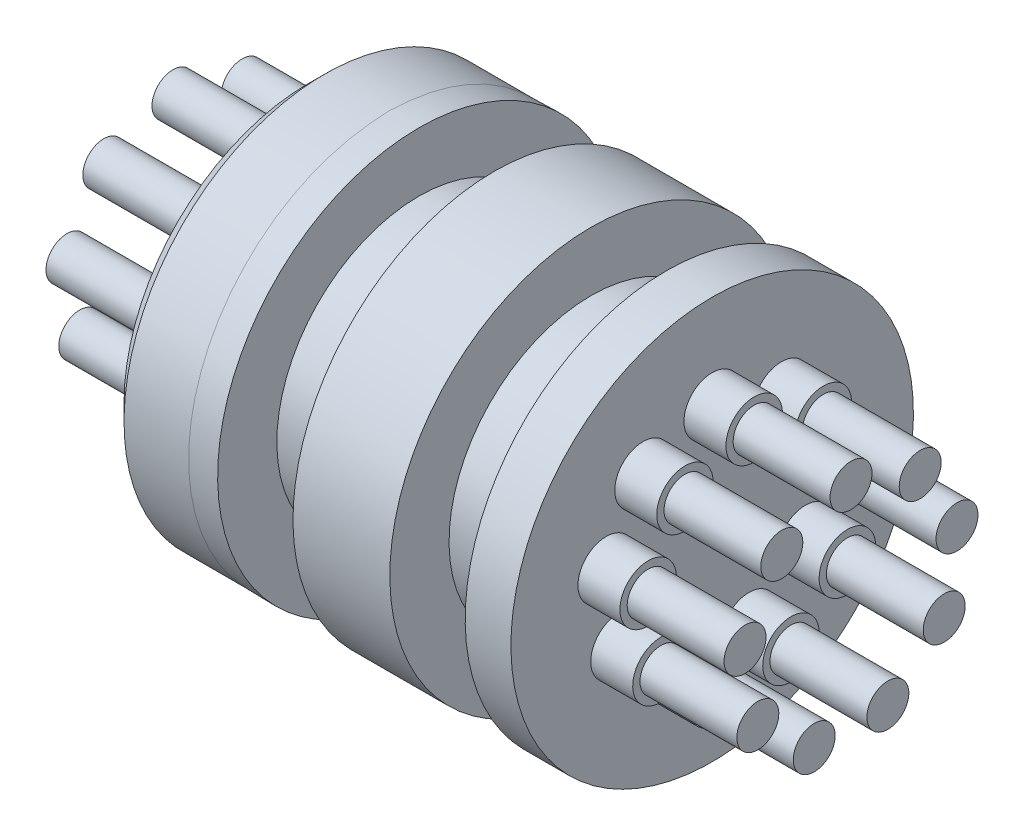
ISO-10303-21;
HEADER;
FILE_DESCRIPTION(('STEP AP214'),'2;1');
FILE_NAME('part.step','',(''),(''),'','','');
FILE_SCHEMA(('AUTOMOTIVE_DESIGN { 1 0 10303 214 1 1 1 1 }'));
ENDSEC;
DATA;
#1=APPLICATION_CONTEXT('core data for automotive mechanical design processes');
#2=APPLICATION_PROTOCOL_DEFINITION('international standard','automotive_design',2000,#1);
#3=PRODUCT_CONTEXT('',#1,'mechanical');
#4=PRODUCT('Part','Part','',(#3));
#5=PRODUCT_RELATED_PRODUCT_CATEGORY('part','',(#4));
#6=PRODUCT_DEFINITION_FORMATION('','',#4);
#7=PRODUCT_DEFINITION_CONTEXT('part definition',#1,'design');
#8=PRODUCT_DEFINITION('design','',#6,#7);
#9=PRODUCT_DEFINITION_SHAPE('','',#8);
#10=(LENGTH_UNIT() NAMED_UNIT(*) SI_UNIT(.MILLI.,.METRE.));
#11=(NAMED_UNIT(*) PLANE_ANGLE_UNIT() SI_UNIT($,.RADIAN.));
#12=(NAMED_UNIT(*) SI_UNIT($,.STERADIAN.) SOLID_ANGLE_UNIT());
#13=UNCERTAINTY_MEASURE_WITH_UNIT(LENGTH_MEASURE(1.E-05),#10,'distance_accuracy_value','');
#14=(GEOMETRIC_REPRESENTATION_CONTEXT(3) GLOBAL_UNCERTAINTY_ASSIGNED_CONTEXT((#13)) GLOBAL_UNIT_ASSIGNED_CONTEXT((#10,
#11,#12)) REPRESENTATION_CONTEXT('',''));
#15=CARTESIAN_POINT('',(0.,0.,0.));
#16=DIRECTION('',(0.,0.,1.));
#17=DIRECTION('',(1.,0.,0.));
#18=AXIS2_PLACEMENT_3D('',#15,#16,#17);
#19=CARTESIAN_POINT('',(-5.3848,3.89150577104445,-3.26536105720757));
#20=DIRECTION('',(-1.,0.,0.));
#21=DIRECTION('',(0.,-0.766044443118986,0.64278760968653));
#22=AXIS2_PLACEMENT_3D('',#19,#20,#21);
#23=PLANE('',#22);
#24=CARTESIAN_POINT('',(-5.3848,3.89150577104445,-3.26536105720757));
#25=DIRECTION('',(-1.,0.,0.));
#26=DIRECTION('',(0.,-0.766044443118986,0.64278760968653));
#27=AXIS2_PLACEMENT_3D('',#24,#25,#26);
#28=CIRCLE('',#27,1.3335);
#29=CARTESIAN_POINT('',(-5.3848,2.86998550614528,-2.40820377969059));
#30=VERTEX_POINT('',#29);
#31=EDGE_CURVE('E78',#30,#30,#28,.T.);
#32=ORIENTED_EDGE('',*,*,#31,.T.);
#33=EDGE_LOOP('',(#32));
#34=FACE_BOUND('',#33,.T.);
#35=CARTESIAN_POINT('',(-5.3848,3.89150577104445,-3.26536105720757));
#36=DIRECTION('',(-1.,0.,0.));
#37=DIRECTION('',(0.,-1.,0.));
#38=AXIS2_PLACEMENT_3D('',#35,#36,#37);
#39=CIRCLE('',#38,0.9906);
#40=CARTESIAN_POINT('',(-5.3848,2.90090577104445,-3.26536105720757));
#41=VERTEX_POINT('',#40);
#42=EDGE_CURVE('E503',#41,#41,#39,.F.);
#43=ORIENTED_EDGE('',*,*,#42,.T.);
#44=EDGE_LOOP('',(#43));
#45=FACE_BOUND('',#44,.T.);
#46=ADVANCED_FACE('F34',(#34,#45),#23,.T.);
#47=CARTESIAN_POINT('',(17.2212,3.89150577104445,-3.26536105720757));
#48=DIRECTION('',(-1.,0.,0.));
#49=DIRECTION('',(0.,-0.766044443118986,0.64278760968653));
#50=AXIS2_PLACEMENT_3D('',#47,#48,#49);
#51=PLANE('',#50);
#52=CARTESIAN_POINT('',(17.2212,3.89150577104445,-3.26536105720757));
#53=DIRECTION('',(-1.,0.,0.));
#54=DIRECTION('',(0.,-0.766044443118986,0.64278760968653));
#55=AXIS2_PLACEMENT_3D('',#52,#53,#54);
#56=CIRCLE('',#55,1.3335);
#57=CARTESIAN_POINT('',(17.2212,2.86998550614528,-2.40820377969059));
#58=VERTEX_POINT('',#57);
#59=EDGE_CURVE('E437',#58,#58,#56,.T.);
#60=ORIENTED_EDGE('',*,*,#59,.F.);
#61=EDGE_LOOP('',(#60));
#62=FACE_BOUND('',#61,.T.);
#63=CARTESIAN_POINT('',(17.2212,3.89150577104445,-3.26536105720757));
#64=DIRECTION('',(-1.,0.,0.));
#65=DIRECTION('',(0.,-1.,0.));
#66=AXIS2_PLACEMENT_3D('',#63,#64,#65);
#67=CIRCLE('',#66,0.9906);
#68=CARTESIAN_POINT('',(17.2212,2.90090577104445,-3.26536105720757));
#69=VERTEX_POINT('',#68);
#70=EDGE_CURVE('E46',#69,#69,#67,.F.);
#71=ORIENTED_EDGE('',*,*,#70,.F.);
#72=EDGE_LOOP('',(#71));
#73=FACE_BOUND('',#72,.T.);
#74=ADVANCED_FACE('F220',(#62,#73),#51,.F.);
#75=CARTESIAN_POINT('',(-5.3848,0.882132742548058,-5.00282338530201));
#76=DIRECTION('',(-1.,0.,0.));
#77=DIRECTION('',(0.,-0.17364817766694,0.984807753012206));
#78=AXIS2_PLACEMENT_3D('',#75,#76,#77);
#79=PLANE('',#78);
#80=CARTESIAN_POINT('',(-5.3848,0.882132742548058,-5.00282338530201));
#81=DIRECTION('',(-1.,0.,0.));
#82=DIRECTION('',(0.,-0.17364817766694,0.984807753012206));
#83=AXIS2_PLACEMENT_3D('',#80,#81,#82);
#84=CIRCLE('',#83,1.3335);
#85=CARTESIAN_POINT('',(-5.3848,0.650572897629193,-3.68958224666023));
#86=VERTEX_POINT('',#85);
#87=EDGE_CURVE('E83',#86,#86,#84,.T.);
#88=ORIENTED_EDGE('',*,*,#87,.T.);
#89=EDGE_LOOP('',(#88));
#90=FACE_BOUND('',#89,.T.);
#91=CARTESIAN_POINT('',(-5.3848,0.882132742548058,-5.00282338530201));
#92=DIRECTION('',(-1.,0.,0.));
#93=DIRECTION('',(0.,-1.,0.));
#94=AXIS2_PLACEMENT_3D('',#91,#92,#93);
#95=CIRCLE('',#94,0.9906);
#96=CARTESIAN_POINT('',(-5.3848,-0.108467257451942,-5.00282338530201));
#97=VERTEX_POINT('',#96);
#98=EDGE_CURVE('E494',#97,#97,#95,.F.);
#99=ORIENTED_EDGE('',*,*,#98,.T.);
#100=EDGE_LOOP('',(#99));
#101=FACE_BOUND('',#100,.T.);
#102=ADVANCED_FACE('F226',(#90,#101),#79,.T.);
#103=CARTESIAN_POINT('',(17.2212,0.882132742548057,-5.00282338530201));
#104=DIRECTION('',(-1.,0.,0.));
#105=DIRECTION('',(0.,-0.17364817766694,0.984807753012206));
#106=AXIS2_PLACEMENT_3D('',#103,#104,#105);
#107=PLANE('',#106);
#108=CARTESIAN_POINT('',(17.2212,0.882132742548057,-5.00282338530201));
#109=DIRECTION('',(-1.,0.,0.));
#110=DIRECTION('',(0.,-0.17364817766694,0.984807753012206));
#111=AXIS2_PLACEMENT_3D('',#108,#109,#110);
#112=CIRCLE('',#111,1.3335);
#113=CARTESIAN_POINT('',(17.2212,0.650572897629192,-3.68958224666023));
#114=VERTEX_POINT('',#113);
#115=EDGE_CURVE('E431',#114,#114,#112,.T.);
#116=ORIENTED_EDGE('',*,*,#115,.F.);
#117=EDGE_LOOP('',(#116));
#118=FACE_BOUND('',#117,.T.);
#119=CARTESIAN_POINT('',(17.2212,0.882132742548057,-5.00282338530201));
#120=DIRECTION('',(-1.,0.,0.));
#121=DIRECTION('',(0.,-1.,0.));
#122=AXIS2_PLACEMENT_3D('',#119,#120,#121);
#123=CIRCLE('',#122,0.9906);
#124=CARTESIAN_POINT('',(17.2212,-0.108467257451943,-5.00282338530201));
#125=VERTEX_POINT('',#124);
#126=EDGE_CURVE('E50',#125,#125,#123,.F.);
#127=ORIENTED_EDGE('',*,*,#126,.F.);
#128=EDGE_LOOP('',(#127));
#129=FACE_BOUND('',#128,.T.);
#130=ADVANCED_FACE('F239',(#118,#129),#107,.F.);
#131=CARTESIAN_POINT('',(-5.3848,-2.53999999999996,-4.39940905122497));
#132=DIRECTION('',(-1.,0.,0.));
#133=DIRECTION('',(0.,0.499999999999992,0.866025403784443));
#134=AXIS2_PLACEMENT_3D('',#131,#132,#133);
#135=PLANE('',#134);
#136=CARTESIAN_POINT('',(-5.3848,-2.53999999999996,-4.39940905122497));
#137=DIRECTION('',(-1.,0.,0.));
#138=DIRECTION('',(0.,0.499999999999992,0.866025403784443));
#139=AXIS2_PLACEMENT_3D('',#136,#137,#138);
#140=CIRCLE('',#139,1.3335);
#141=CARTESIAN_POINT('',(-5.3848,-1.87324999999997,-3.24456417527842));
#142=VERTEX_POINT('',#141);
#143=EDGE_CURVE('E88',#142,#142,#140,.T.);
#144=ORIENTED_EDGE('',*,*,#143,.T.);
#145=EDGE_LOOP('',(#144));
#146=FACE_BOUND('',#145,.T.);
#147=CARTESIAN_POINT('',(-5.3848,-2.53999999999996,-4.39940905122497));
#148=DIRECTION('',(-1.,0.,0.));
#149=DIRECTION('',(0.,-1.,0.));
#150=AXIS2_PLACEMENT_3D('',#147,#148,#149);
#151=CIRCLE('',#150,0.9906);
#152=CARTESIAN_POINT('',(-5.3848,-3.53059999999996,-4.39940905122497));
#153=VERTEX_POINT('',#152);
#154=EDGE_CURVE('E485',#153,#153,#151,.F.);
#155=ORIENTED_EDGE('',*,*,#154,.T.);
#156=EDGE_LOOP('',(#155));
#157=FACE_BOUND('',#156,.T.);
#158=ADVANCED_FACE('F242',(#146,#157),#135,.T.);
#159=CARTESIAN_POINT('',(17.2212,-2.53999999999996,-4.39940905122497));
#160=DIRECTION('',(-1.,0.,0.));
#161=DIRECTION('',(0.,0.499999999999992,0.866025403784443));
#162=AXIS2_PLACEMENT_3D('',#159,#160,#161);
#163=PLANE('',#162);
#164=CARTESIAN_POINT('',(17.2212,-2.53999999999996,-4.39940905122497));
#165=DIRECTION('',(-1.,0.,0.));
#166=DIRECTION('',(0.,0.499999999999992,0.866025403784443));
#167=AXIS2_PLACEMENT_3D('',#164,#165,#166);
#168=CIRCLE('',#167,1.3335);
#169=CARTESIAN_POINT('',(17.2212,-1.87324999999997,-3.24456417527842));
#170=VERTEX_POINT('',#169);
#171=EDGE_CURVE('E424',#170,#170,#168,.T.);
#172=ORIENTED_EDGE('',*,*,#171,.F.);
#173=EDGE_LOOP('',(#172));
#174=FACE_BOUND('',#173,.T.);
#175=CARTESIAN_POINT('',(17.2212,-2.53999999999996,-4.39940905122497));
#176=DIRECTION('',(-1.,0.,0.));
#177=DIRECTION('',(0.,-1.,0.));
#178=AXIS2_PLACEMENT_3D('',#175,#176,#177);
#179=CIRCLE('',#178,0.9906);
#180=CARTESIAN_POINT('',(17.2212,-3.53059999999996,-4.39940905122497));
#181=VERTEX_POINT('',#180);
#182=EDGE_CURVE('E55',#181,#181,#179,.F.);
#183=ORIENTED_EDGE('',*,*,#182,.F.);
#184=EDGE_LOOP('',(#183));
#185=FACE_BOUND('',#184,.T.);
#186=ADVANCED_FACE('F252',(#174,#185),#163,.F.);
#187=CARTESIAN_POINT('',(-5.3848,-4.7736385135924,-1.73746232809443));
#188=DIRECTION('',(-1.,0.,0.));
#189=DIRECTION('',(0.,0.939692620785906,0.342020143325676));
#190=AXIS2_PLACEMENT_3D('',#187,#188,#189);
#191=PLANE('',#190);
#192=CARTESIAN_POINT('',(-5.3848,-4.7736385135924,-1.73746232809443));
#193=DIRECTION('',(-1.,0.,0.));
#194=DIRECTION('',(0.,0.939692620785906,0.342020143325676));
#195=AXIS2_PLACEMENT_3D('',#192,#193,#194);
#196=CIRCLE('',#195,1.3335);
#197=CARTESIAN_POINT('',(-5.3848,-3.5205584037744,-1.28137846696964));
#198=VERTEX_POINT('',#197);
#199=EDGE_CURVE('E93',#198,#198,#196,.T.);
#200=ORIENTED_EDGE('',*,*,#199,.T.);
#201=EDGE_LOOP('',(#200));
#202=FACE_BOUND('',#201,.T.);
#203=CARTESIAN_POINT('',(-5.3848,-4.7736385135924,-1.73746232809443));
#204=DIRECTION('',(-1.,0.,0.));
#205=DIRECTION('',(0.,-1.,0.));
#206=AXIS2_PLACEMENT_3D('',#203,#204,#205);
#207=CIRCLE('',#206,0.9906);
#208=CARTESIAN_POINT('',(-5.3848,-5.7642385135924,-1.73746232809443));
#209=VERTEX_POINT('',#208);
#210=EDGE_CURVE('E476',#209,#209,#207,.F.);
#211=ORIENTED_EDGE('',*,*,#210,.T.);
#212=EDGE_LOOP('',(#211));
#213=FACE_BOUND('',#212,.T.);
#214=ADVANCED_FACE('F255',(#202,#213),#191,.T.);
#215=CARTESIAN_POINT('',(17.2212,-4.7736385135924,-1.73746232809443));
#216=DIRECTION('',(-1.,0.,0.));
#217=DIRECTION('',(0.,0.939692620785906,0.342020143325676));
#218=AXIS2_PLACEMENT_3D('',#215,#216,#217);
#219=PLANE('',#218);
#220=CARTESIAN_POINT('',(17.2212,-4.7736385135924,-1.73746232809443));
#221=DIRECTION('',(-1.,0.,0.));
#222=DIRECTION('',(0.,0.939692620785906,0.342020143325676));
#223=AXIS2_PLACEMENT_3D('',#220,#221,#222);
#224=CIRCLE('',#223,1.3335);
#225=CARTESIAN_POINT('',(17.2212,-3.5205584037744,-1.28137846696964));
#226=VERTEX_POINT('',#225);
#227=EDGE_CURVE('E417',#226,#226,#224,.T.);
#228=ORIENTED_EDGE('',*,*,#227,.F.);
#229=EDGE_LOOP('',(#228));
#230=FACE_BOUND('',#229,.T.);
#231=CARTESIAN_POINT('',(17.2212,-4.7736385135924,-1.73746232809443));
#232=DIRECTION('',(-1.,0.,0.));
#233=DIRECTION('',(0.,-1.,0.));
#234=AXIS2_PLACEMENT_3D('',#231,#232,#233);
#235=CIRCLE('',#234,0.9906);
#236=CARTESIAN_POINT('',(17.2212,-5.7642385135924,-1.73746232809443));
#237=VERTEX_POINT('',#236);
#238=EDGE_CURVE('E58',#237,#237,#235,.F.);
#239=ORIENTED_EDGE('',*,*,#238,.F.);
#240=EDGE_LOOP('',(#239));
#241=FACE_BOUND('',#240,.T.);
#242=ADVANCED_FACE('F265',(#230,#241),#219,.F.);
#243=CARTESIAN_POINT('',(-5.3848,-4.77363851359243,1.73746232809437));
#244=DIRECTION('',(-1.,0.,0.));
#245=DIRECTION('',(0.,0.939692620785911,-0.342020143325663));
#246=AXIS2_PLACEMENT_3D('',#243,#244,#245);
#247=PLANE('',#246);
#248=CARTESIAN_POINT('',(-5.3848,-4.77363851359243,1.73746232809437));
#249=DIRECTION('',(-1.,0.,0.));
#250=DIRECTION('',(0.,0.939692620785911,-0.342020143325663));
#251=AXIS2_PLACEMENT_3D('',#248,#249,#250);
#252=CIRCLE('',#251,1.3335);
#253=CARTESIAN_POINT('',(-5.3848,-3.52055840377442,1.2813784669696));
#254=VERTEX_POINT('',#253);
#255=EDGE_CURVE('E98',#254,#254,#252,.T.);
#256=ORIENTED_EDGE('',*,*,#255,.T.);
#257=EDGE_LOOP('',(#256));
#258=FACE_BOUND('',#257,.T.);
#259=CARTESIAN_POINT('',(-5.3848,-4.77363851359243,1.73746232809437));
#260=DIRECTION('',(-1.,0.,0.));
#261=DIRECTION('',(0.,-1.,0.));
#262=AXIS2_PLACEMENT_3D('',#259,#260,#261);
#263=CIRCLE('',#262,0.9906);
#264=CARTESIAN_POINT('',(-5.3848,-5.76423851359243,1.73746232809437));
#265=VERTEX_POINT('',#264);
#266=EDGE_CURVE('E467',#265,#265,#263,.F.);
#267=ORIENTED_EDGE('',*,*,#266,.T.);
#268=EDGE_LOOP('',(#267));
#269=FACE_BOUND('',#268,.T.);
#270=ADVANCED_FACE('F268',(#258,#269),#247,.T.);
#271=CARTESIAN_POINT('',(17.2212,-4.77363851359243,1.73746232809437));
#272=DIRECTION('',(-1.,0.,0.));
#273=DIRECTION('',(0.,0.939692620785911,-0.342020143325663));
#274=AXIS2_PLACEMENT_3D('',#271,#272,#273);
#275=PLANE('',#274);
#276=CARTESIAN_POINT('',(17.2212,-4.77363851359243,1.73746232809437));
#277=DIRECTION('',(-1.,0.,0.));
#278=DIRECTION('',(0.,0.939692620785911,-0.342020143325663));
#279=AXIS2_PLACEMENT_3D('',#276,#277,#278);
#280=CIRCLE('',#279,1.3335);
#281=CARTESIAN_POINT('',(17.2212,-3.52055840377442,1.2813784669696));
#282=VERTEX_POINT('',#281);
#283=EDGE_CURVE('E410',#282,#282,#280,.T.);
#284=ORIENTED_EDGE('',*,*,#283,.F.);
#285=EDGE_LOOP('',(#284));
#286=FACE_BOUND('',#285,.T.);
#287=CARTESIAN_POINT('',(17.2212,-4.77363851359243,1.73746232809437));
#288=DIRECTION('',(-1.,0.,0.));
#289=DIRECTION('',(0.,-1.,0.));
#290=AXIS2_PLACEMENT_3D('',#287,#288,#289);
#291=CIRCLE('',#290,0.9906);
#292=CARTESIAN_POINT('',(17.2212,-5.76423851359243,1.73746232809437));
#293=VERTEX_POINT('',#292);
#294=EDGE_CURVE('E61',#293,#293,#291,.F.);
#295=ORIENTED_EDGE('',*,*,#294,.F.);
#296=EDGE_LOOP('',(#295));
#297=FACE_BOUND('',#296,.T.);
#298=ADVANCED_FACE('F278',(#286,#297),#275,.F.);
#299=CARTESIAN_POINT('',(-5.3848,-2.54000000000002,4.39940905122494));
#300=DIRECTION('',(-1.,0.,0.));
#301=DIRECTION('',(0.,0.500000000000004,-0.866025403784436));
#302=AXIS2_PLACEMENT_3D('',#299,#300,#301);
#303=PLANE('',#302);
#304=CARTESIAN_POINT('',(-5.3848,-2.54000000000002,4.39940905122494));
#305=DIRECTION('',(-1.,0.,0.));
#306=DIRECTION('',(0.,0.500000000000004,-0.866025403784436));
#307=AXIS2_PLACEMENT_3D('',#304,#305,#306);
#308=CIRCLE('',#307,1.3335);
#309=CARTESIAN_POINT('',(-5.3848,-1.87325000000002,3.24456417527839));
#310=VERTEX_POINT('',#309);
#311=EDGE_CURVE('E103',#310,#310,#308,.T.);
#312=ORIENTED_EDGE('',*,*,#311,.T.);
#313=EDGE_LOOP('',(#312));
#314=FACE_BOUND('',#313,.T.);
#315=CARTESIAN_POINT('',(-5.3848,-2.54000000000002,4.39940905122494));
#316=DIRECTION('',(-1.,0.,0.));
#317=DIRECTION('',(0.,-1.,0.));
#318=AXIS2_PLACEMENT_3D('',#315,#316,#317);
#319=CIRCLE('',#318,0.9906);
#320=CARTESIAN_POINT('',(-5.3848,-3.53060000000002,4.39940905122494));
#321=VERTEX_POINT('',#320);
#322=EDGE_CURVE('E458',#321,#321,#319,.F.);
#323=ORIENTED_EDGE('',*,*,#322,.T.);
#324=EDGE_LOOP('',(#323));
#325=FACE_BOUND('',#324,.T.);
#326=ADVANCED_FACE('F281',(#314,#325),#303,.T.);
#327=CARTESIAN_POINT('',(17.2212,-2.54000000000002,4.39940905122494));
#328=DIRECTION('',(-1.,0.,0.));
#329=DIRECTION('',(0.,0.500000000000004,-0.866025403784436));
#330=AXIS2_PLACEMENT_3D('',#327,#328,#329);
#331=PLANE('',#330);
#332=CARTESIAN_POINT('',(17.2212,-2.54000000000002,4.39940905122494));
#333=DIRECTION('',(-1.,0.,0.));
#334=DIRECTION('',(0.,0.500000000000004,-0.866025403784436));
#335=AXIS2_PLACEMENT_3D('',#332,#333,#334);
#336=CIRCLE('',#335,1.3335);
#337=CARTESIAN_POINT('',(17.2212,-1.87325000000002,3.24456417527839));
#338=VERTEX_POINT('',#337);
#339=EDGE_CURVE('E403',#338,#338,#336,.T.);
#340=ORIENTED_EDGE('',*,*,#339,.F.);
#341=EDGE_LOOP('',(#340));
#342=FACE_BOUND('',#341,.T.);
#343=CARTESIAN_POINT('',(17.2212,-2.54000000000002,4.39940905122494));
#344=DIRECTION('',(-1.,0.,0.));
#345=DIRECTION('',(0.,-1.,0.));
#346=AXIS2_PLACEMENT_3D('',#343,#344,#345);
#347=CIRCLE('',#346,0.9906);
#348=CARTESIAN_POINT('',(17.2212,-3.53060000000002,4.39940905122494));
#349=VERTEX_POINT('',#348);
#350=EDGE_CURVE('E64',#349,#349,#347,.F.);
#351=ORIENTED_EDGE('',*,*,#350,.F.);
#352=EDGE_LOOP('',(#351));
#353=FACE_BOUND('',#352,.T.);
#354=ADVANCED_FACE('F291',(#342,#353),#331,.F.);
#355=CARTESIAN_POINT('',(-5.3848,0.882132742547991,5.00282338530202));
#356=DIRECTION('',(-1.,0.,0.));
#357=DIRECTION('',(0.,-0.173648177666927,-0.984807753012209));
#358=AXIS2_PLACEMENT_3D('',#355,#356,#357);
#359=PLANE('',#358);
#360=CARTESIAN_POINT('',(-5.3848,0.882132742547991,5.00282338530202));
#361=DIRECTION('',(-1.,0.,0.));
#362=DIRECTION('',(0.,-0.173648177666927,-0.984807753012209));
#363=AXIS2_PLACEMENT_3D('',#360,#361,#362);
#364=CIRCLE('',#363,1.3335);
#365=CARTESIAN_POINT('',(-5.3848,0.650572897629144,3.68958224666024));
#366=VERTEX_POINT('',#365);
#367=EDGE_CURVE('E108',#366,#366,#364,.T.);
#368=ORIENTED_EDGE('',*,*,#367,.T.);
#369=EDGE_LOOP('',(#368));
#370=FACE_BOUND('',#369,.T.);
#371=CARTESIAN_POINT('',(-5.3848,0.882132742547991,5.00282338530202));
#372=DIRECTION('',(-1.,0.,0.));
#373=DIRECTION('',(0.,-1.,0.));
#374=AXIS2_PLACEMENT_3D('',#371,#372,#373);
#375=CIRCLE('',#374,0.9906);
#376=CARTESIAN_POINT('',(-5.3848,-0.108467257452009,5.00282338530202));
#377=VERTEX_POINT('',#376);
#378=EDGE_CURVE('E449',#377,#377,#375,.F.);
#379=ORIENTED_EDGE('',*,*,#378,.T.);
#380=EDGE_LOOP('',(#379));
#381=FACE_BOUND('',#380,.T.);
#382=ADVANCED_FACE('F294',(#370,#381),#359,.T.);
#383=CARTESIAN_POINT('',(17.2212,0.882132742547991,5.00282338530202));
#384=DIRECTION('',(-1.,0.,0.));
#385=DIRECTION('',(0.,-0.173648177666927,-0.984807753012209));
#386=AXIS2_PLACEMENT_3D('',#383,#384,#385);
#387=PLANE('',#386);
#388=CARTESIAN_POINT('',(17.2212,0.882132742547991,5.00282338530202));
#389=DIRECTION('',(-1.,0.,0.));
#390=DIRECTION('',(0.,-0.173648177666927,-0.984807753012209));
#391=AXIS2_PLACEMENT_3D('',#388,#389,#390);
#392=CIRCLE('',#391,1.3335);
#393=CARTESIAN_POINT('',(17.2212,0.650572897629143,3.68958224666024));
#394=VERTEX_POINT('',#393);
#395=EDGE_CURVE('E396',#394,#394,#392,.T.);
#396=ORIENTED_EDGE('',*,*,#395,.F.);
#397=EDGE_LOOP('',(#396));
#398=FACE_BOUND('',#397,.T.);
#399=CARTESIAN_POINT('',(17.2212,0.88213274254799,5.00282338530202));
#400=DIRECTION('',(-1.,0.,0.));
#401=DIRECTION('',(0.,-1.,0.));
#402=AXIS2_PLACEMENT_3D('',#399,#400,#401);
#403=CIRCLE('',#402,0.9906);
#404=CARTESIAN_POINT('',(17.2212,-0.108467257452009,5.00282338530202));
#405=VERTEX_POINT('',#404);
#406=EDGE_CURVE('E67',#405,#405,#403,.F.);
#407=ORIENTED_EDGE('',*,*,#406,.F.);
#408=EDGE_LOOP('',(#407));
#409=FACE_BOUND('',#408,.T.);
#410=ADVANCED_FACE('F304',(#398,#409),#387,.F.);
#411=CARTESIAN_POINT('',(-5.3848,3.8915057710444,3.26536105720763));
#412=DIRECTION('',(-1.,0.,0.));
#413=DIRECTION('',(0.,-0.766044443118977,-0.642787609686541));
#414=AXIS2_PLACEMENT_3D('',#411,#412,#413);
#415=PLANE('',#414);
#416=CARTESIAN_POINT('',(-5.3848,3.8915057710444,3.26536105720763));
#417=DIRECTION('',(-1.,0.,0.));
#418=DIRECTION('',(0.,-0.766044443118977,-0.642787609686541));
#419=AXIS2_PLACEMENT_3D('',#416,#417,#418);
#420=CIRCLE('',#419,1.3335);
#421=CARTESIAN_POINT('',(-5.3848,2.86998550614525,2.40820377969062));
#422=VERTEX_POINT('',#421);
#423=EDGE_CURVE('E113',#422,#422,#420,.T.);
#424=ORIENTED_EDGE('',*,*,#423,.T.);
#425=EDGE_LOOP('',(#424));
#426=FACE_BOUND('',#425,.T.);
#427=CARTESIAN_POINT('',(-5.3848,3.8915057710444,3.26536105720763));
#428=DIRECTION('',(-1.,0.,0.));
#429=DIRECTION('',(0.,-1.,0.));
#430=AXIS2_PLACEMENT_3D('',#427,#428,#429);
#431=CIRCLE('',#430,0.9906);
#432=CARTESIAN_POINT('',(-5.3848,2.9009057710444,3.26536105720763));
#433=VERTEX_POINT('',#432);
#434=EDGE_CURVE('E440',#433,#433,#431,.F.);
#435=ORIENTED_EDGE('',*,*,#434,.T.);
#436=EDGE_LOOP('',(#435));
#437=FACE_BOUND('',#436,.T.);
#438=ADVANCED_FACE('F307',(#426,#437),#415,.T.);
#439=CARTESIAN_POINT('',(17.2212,3.8915057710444,3.26536105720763));
#440=DIRECTION('',(-1.,0.,0.));
#441=DIRECTION('',(0.,-0.766044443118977,-0.642787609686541));
#442=AXIS2_PLACEMENT_3D('',#439,#440,#441);
#443=PLANE('',#442);
#444=CARTESIAN_POINT('',(17.2212,3.8915057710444,3.26536105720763));
#445=DIRECTION('',(-1.,0.,0.));
#446=DIRECTION('',(0.,-0.766044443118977,-0.642787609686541));
#447=AXIS2_PLACEMENT_3D('',#444,#445,#446);
#448=CIRCLE('',#447,1.3335);
#449=CARTESIAN_POINT('',(17.2212,2.86998550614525,2.40820377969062));
#450=VERTEX_POINT('',#449);
#451=EDGE_CURVE('E389',#450,#450,#448,.T.);
#452=ORIENTED_EDGE('',*,*,#451,.F.);
#453=EDGE_LOOP('',(#452));
#454=FACE_BOUND('',#453,.T.);
#455=CARTESIAN_POINT('',(17.2212,3.8915057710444,3.26536105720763));
#456=DIRECTION('',(-1.,0.,0.));
#457=DIRECTION('',(0.,-1.,0.));
#458=AXIS2_PLACEMENT_3D('',#455,#456,#457);
#459=CIRCLE('',#458,0.9906);
#460=CARTESIAN_POINT('',(17.2212,2.9009057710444,3.26536105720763));
#461=VERTEX_POINT('',#460);
#462=EDGE_CURVE('E70',#461,#461,#459,.F.);
#463=ORIENTED_EDGE('',*,*,#462,.F.);
#464=EDGE_LOOP('',(#463));
#465=FACE_BOUND('',#464,.T.);
#466=ADVANCED_FACE('F183',(#454,#465),#443,.F.);
#467=CARTESIAN_POINT('',(15.24,9.4996,0.));
#468=DIRECTION('',(1.,0.,0.));
#469=DIRECTION('',(0.,1.,0.));
#470=AXIS2_PLACEMENT_3D('',#467,#468,#469);
#471=PLANE('',#470);
#472=CARTESIAN_POINT('',(15.24,0.882132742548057,-5.00282338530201));
#473=DIRECTION('',(1.,0.,0.));
#474=DIRECTION('',(0.,1.,0.));
#475=AXIS2_PLACEMENT_3D('',#472,#473,#474);
#476=CIRCLE('',#475,1.3335);
#477=CARTESIAN_POINT('',(15.24,2.21563274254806,-5.00282338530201));
#478=VERTEX_POINT('',#477);
#479=EDGE_CURVE('E82',#478,#478,#476,.F.);
#480=ORIENTED_EDGE('',*,*,#479,.T.);
#481=EDGE_LOOP('',(#480));
#482=FACE_BOUND('',#481,.T.);
#483=CARTESIAN_POINT('',(15.24,-4.7736385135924,-1.73746232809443));
#484=DIRECTION('',(1.,0.,0.));
#485=DIRECTION('',(0.,1.,0.));
#486=AXIS2_PLACEMENT_3D('',#483,#484,#485);
#487=CIRCLE('',#486,1.3335);
#488=CARTESIAN_POINT('',(15.24,-3.4401385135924,-1.73746232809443));
#489=VERTEX_POINT('',#488);
#490=EDGE_CURVE('E92',#489,#489,#487,.F.);
#491=ORIENTED_EDGE('',*,*,#490,.T.);
#492=EDGE_LOOP('',(#491));
#493=FACE_BOUND('',#492,.T.);
#494=CARTESIAN_POINT('',(15.24,-2.54000000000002,4.39940905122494));
#495=DIRECTION('',(1.,0.,0.));
#496=DIRECTION('',(0.,1.,0.));
#497=AXIS2_PLACEMENT_3D('',#494,#495,#496);
#498=CIRCLE('',#497,1.3335);
#499=CARTESIAN_POINT('',(15.24,-1.20650000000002,4.39940905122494));
#500=VERTEX_POINT('',#499);
#501=EDGE_CURVE('E102',#500,#500,#498,.F.);
#502=ORIENTED_EDGE('',*,*,#501,.T.);
#503=EDGE_LOOP('',(#502));
#504=FACE_BOUND('',#503,.T.);
#505=CARTESIAN_POINT('',(15.24,3.8915057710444,3.26536105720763));
#506=DIRECTION('',(1.,0.,0.));
#507=DIRECTION('',(0.,1.,0.));
#508=AXIS2_PLACEMENT_3D('',#505,#506,#507);
#509=CIRCLE('',#508,1.3335);
#510=CARTESIAN_POINT('',(15.24,5.2250057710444,3.26536105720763));
#511=VERTEX_POINT('',#510);
#512=EDGE_CURVE('E112',#511,#511,#509,.F.);
#513=ORIENTED_EDGE('',*,*,#512,.T.);
#514=EDGE_LOOP('',(#513));
#515=FACE_BOUND('',#514,.T.);
#516=CARTESIAN_POINT('',(15.24,0.,0.));
#517=DIRECTION('',(1.,0.,0.));
#518=DIRECTION('',(0.,1.,0.));
#519=AXIS2_PLACEMENT_3D('',#516,#517,#518);
#520=CIRCLE('',#519,9.4996);
#521=CARTESIAN_POINT('',(15.24,9.4996,0.));
#522=VERTEX_POINT('',#521);
#523=EDGE_CURVE('E158',#522,#522,#520,.T.);
#524=ORIENTED_EDGE('',*,*,#523,.T.);
#525=EDGE_LOOP('',(#524));
#526=FACE_BOUND('',#525,.T.);
#527=CARTESIAN_POINT('',(15.24,5.08,0.));
#528=DIRECTION('',(1.,0.,0.));
#529=DIRECTION('',(0.,1.,0.));
#530=AXIS2_PLACEMENT_3D('',#527,#528,#529);
#531=CIRCLE('',#530,1.3335);
#532=CARTESIAN_POINT('',(15.24,6.4135,0.));
#533=VERTEX_POINT('',#532);
#534=EDGE_CURVE('E120',#533,#533,#531,.F.);
#535=ORIENTED_EDGE('',*,*,#534,.T.);
#536=EDGE_LOOP('',(#535));
#537=FACE_BOUND('',#536,.T.);
#538=CARTESIAN_POINT('',(15.24,0.882132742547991,5.00282338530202));
#539=DIRECTION('',(1.,0.,0.));
#540=DIRECTION('',(0.,1.,0.));
#541=AXIS2_PLACEMENT_3D('',#538,#539,#540);
#542=CIRCLE('',#541,1.3335);
#543=CARTESIAN_POINT('',(15.24,2.21563274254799,5.00282338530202));
#544=VERTEX_POINT('',#543);
#545=EDGE_CURVE('E107',#544,#544,#542,.F.);
#546=ORIENTED_EDGE('',*,*,#545,.T.);
#547=EDGE_LOOP('',(#546));
#548=FACE_BOUND('',#547,.T.);
#549=CARTESIAN_POINT('',(15.24,-4.77363851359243,1.73746232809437));
#550=DIRECTION('',(1.,0.,0.));
#551=DIRECTION('',(0.,1.,0.));
#552=AXIS2_PLACEMENT_3D('',#549,#550,#551);
#553=CIRCLE('',#552,1.3335);
#554=CARTESIAN_POINT('',(15.24,-3.44013851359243,1.73746232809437));
#555=VERTEX_POINT('',#554);
#556=EDGE_CURVE('E97',#555,#555,#553,.F.);
#557=ORIENTED_EDGE('',*,*,#556,.T.);
#558=EDGE_LOOP('',(#557));
#559=FACE_BOUND('',#558,.T.);
#560=CARTESIAN_POINT('',(15.24,-2.53999999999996,-4.39940905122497));
#561=DIRECTION('',(1.,0.,0.));
#562=DIRECTION('',(0.,1.,0.));
#563=AXIS2_PLACEMENT_3D('',#560,#561,#562);
#564=CIRCLE('',#563,1.3335);
#565=CARTESIAN_POINT('',(15.24,-1.20649999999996,-4.39940905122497));
#566=VERTEX_POINT('',#565);
#567=EDGE_CURVE('E87',#566,#566,#564,.F.);
#568=ORIENTED_EDGE('',*,*,#567,.T.);
#569=EDGE_LOOP('',(#568));
#570=FACE_BOUND('',#569,.T.);
#571=CARTESIAN_POINT('',(15.24,3.89150577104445,-3.26536105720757));
#572=DIRECTION('',(1.,0.,0.));
#573=DIRECTION('',(0.,1.,0.));
#574=AXIS2_PLACEMENT_3D('',#571,#572,#573);
#575=CIRCLE('',#574,1.3335);
#576=CARTESIAN_POINT('',(15.24,5.22500577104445,-3.26536105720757));
#577=VERTEX_POINT('',#576);
#578=EDGE_CURVE('E77',#577,#577,#575,.F.);
#579=ORIENTED_EDGE('',*,*,#578,.T.);
#580=EDGE_LOOP('',(#579));
#581=FACE_BOUND('',#580,.T.);
#582=ADVANCED_FACE('F180',(#482,#493,#504,#515,#526,#537,#548,#559,#570,#581),#471,.T.);
#583=CARTESIAN_POINT('',(-3.81,0.,0.));
#584=DIRECTION('',(-1.,0.,0.));
#585=DIRECTION('',(0.,-1.,0.));
#586=AXIS2_PLACEMENT_3D('',#583,#584,#585);
#587=PLANE('',#586);
#588=CARTESIAN_POINT('',(-3.81,0.,0.));
#589=DIRECTION('',(-1.,0.,0.));
#590=DIRECTION('',(0.,-1.,0.));
#591=AXIS2_PLACEMENT_3D('',#588,#589,#590);
#592=CIRCLE('',#591,8.71220000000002);
#593=CARTESIAN_POINT('',(-3.81,-8.71220000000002,0.));
#594=VERTEX_POINT('',#593);
#595=EDGE_CURVE('E42',#594,#594,#592,.T.);
#596=ORIENTED_EDGE('',*,*,#595,.T.);
#597=EDGE_LOOP('',(#596));
#598=FACE_BOUND('',#597,.T.);
#599=CARTESIAN_POINT('',(-3.81,0.882132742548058,-5.00282338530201));
#600=DIRECTION('',(-1.,0.,0.));
#601=DIRECTION('',(0.,-1.,0.));
#602=AXIS2_PLACEMENT_3D('',#599,#600,#601);
#603=CIRCLE('',#602,1.3335);
#604=CARTESIAN_POINT('',(-3.81,-0.451367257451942,-5.00282338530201));
#605=VERTEX_POINT('',#604);
#606=EDGE_CURVE('E79',#605,#605,#603,.F.);
#607=ORIENTED_EDGE('',*,*,#606,.T.);
#608=EDGE_LOOP('',(#607));
#609=FACE_BOUND('',#608,.T.);
#610=CARTESIAN_POINT('',(-3.81,-4.7736385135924,-1.73746232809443));
#611=DIRECTION('',(-1.,0.,0.));
#612=DIRECTION('',(0.,-1.,0.));
#613=AXIS2_PLACEMENT_3D('',#610,#611,#612);
#614=CIRCLE('',#613,1.3335);
#615=CARTESIAN_POINT('',(-3.81,-6.1071385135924,-1.73746232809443));
#616=VERTEX_POINT('',#615);
#617=EDGE_CURVE('E89',#616,#616,#614,.F.);
#618=ORIENTED_EDGE('',*,*,#617,.T.);
#619=EDGE_LOOP('',(#618));
#620=FACE_BOUND('',#619,.T.);
#621=CARTESIAN_POINT('',(-3.81,-2.54000000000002,4.39940905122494));
#622=DIRECTION('',(-1.,0.,0.));
#623=DIRECTION('',(0.,-1.,0.));
#624=AXIS2_PLACEMENT_3D('',#621,#622,#623);
#625=CIRCLE('',#624,1.3335);
#626=CARTESIAN_POINT('',(-3.81,-3.87350000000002,4.39940905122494));
#627=VERTEX_POINT('',#626);
#628=EDGE_CURVE('E99',#627,#627,#625,.F.);
#629=ORIENTED_EDGE('',*,*,#628,.T.);
#630=EDGE_LOOP('',(#629));
#631=FACE_BOUND('',#630,.T.);
#632=CARTESIAN_POINT('',(-3.81,3.8915057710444,3.26536105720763));
#633=DIRECTION('',(-1.,0.,0.));
#634=DIRECTION('',(0.,-1.,0.));
#635=AXIS2_PLACEMENT_3D('',#632,#633,#634);
#636=CIRCLE('',#635,1.3335);
#637=CARTESIAN_POINT('',(-3.81,2.5580057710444,3.26536105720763));
#638=VERTEX_POINT('',#637);
#639=EDGE_CURVE('E109',#638,#638,#636,.F.);
#640=ORIENTED_EDGE('',*,*,#639,.T.);
#641=EDGE_LOOP('',(#640));
#642=FACE_BOUND('',#641,.T.);
#643=CARTESIAN_POINT('',(-3.81,0.,0.));
#644=DIRECTION('',(-1.,0.,0.));
#645=DIRECTION('',(0.,-1.,0.));
#646=AXIS2_PLACEMENT_3D('',#643,#644,#645);
#647=CIRCLE('',#646,2.0447);
#648=CARTESIAN_POINT('',(-3.81,-2.0447,0.));
#649=VERTEX_POINT('',#648);
#650=EDGE_CURVE('E365',#649,#649,#647,.T.);
#651=ORIENTED_EDGE('',*,*,#650,.F.);
#652=EDGE_LOOP('',(#651));
#653=FACE_BOUND('',#652,.T.);
#654=CARTESIAN_POINT('',(-3.81,5.08,0.));
#655=DIRECTION('',(-1.,0.,0.));
#656=DIRECTION('',(0.,-1.,0.));
#657=AXIS2_PLACEMENT_3D('',#654,#655,#656);
#658=CIRCLE('',#657,1.3335);
#659=CARTESIAN_POINT('',(-3.81,3.7465,0.));
#660=VERTEX_POINT('',#659);
#661=EDGE_CURVE('E117',#660,#660,#658,.F.);
#662=ORIENTED_EDGE('',*,*,#661,.T.);
#663=EDGE_LOOP('',(#662));
#664=FACE_BOUND('',#663,.T.);
#665=CARTESIAN_POINT('',(-3.81,0.882132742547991,5.00282338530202));
#666=DIRECTION('',(-1.,0.,0.));
#667=DIRECTION('',(0.,-1.,0.));
#668=AXIS2_PLACEMENT_3D('',#665,#666,#667);
#669=CIRCLE('',#668,1.3335);
#670=CARTESIAN_POINT('',(-3.81,-0.451367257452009,5.00282338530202));
#671=VERTEX_POINT('',#670);
#672=EDGE_CURVE('E104',#671,#671,#669,.F.);
#673=ORIENTED_EDGE('',*,*,#672,.T.);
#674=EDGE_LOOP('',(#673));
#675=FACE_BOUND('',#674,.T.);
#676=CARTESIAN_POINT('',(-3.81,-4.77363851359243,1.73746232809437));
#677=DIRECTION('',(-1.,0.,0.));
#678=DIRECTION('',(0.,-1.,0.));
#679=AXIS2_PLACEMENT_3D('',#676,#677,#678);
#680=CIRCLE('',#679,1.3335);
#681=CARTESIAN_POINT('',(-3.81,-6.10713851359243,1.73746232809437));
#682=VERTEX_POINT('',#681);
#683=EDGE_CURVE('E94',#682,#682,#680,.F.);
#684=ORIENTED_EDGE('',*,*,#683,.T.);
#685=EDGE_LOOP('',(#684));
#686=FACE_BOUND('',#685,.T.);
#687=CARTESIAN_POINT('',(-3.81,-2.53999999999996,-4.39940905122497));
#688=DIRECTION('',(-1.,0.,0.));
#689=DIRECTION('',(0.,-1.,0.));
#690=AXIS2_PLACEMENT_3D('',#687,#688,#689);
#691=CIRCLE('',#690,1.3335);
#692=CARTESIAN_POINT('',(-3.81,-3.87349999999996,-4.39940905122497));
#693=VERTEX_POINT('',#692);
#694=EDGE_CURVE('E84',#693,#693,#691,.F.);
#695=ORIENTED_EDGE('',*,*,#694,.T.);
#696=EDGE_LOOP('',(#695));
#697=FACE_BOUND('',#696,.T.);
#698=CARTESIAN_POINT('',(-3.81,3.89150577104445,-3.26536105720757));
#699=DIRECTION('',(-1.,0.,0.));
#700=DIRECTION('',(0.,-1.,0.));
#701=AXIS2_PLACEMENT_3D('',#698,#699,#700);
#702=CIRCLE('',#701,1.3335);
#703=CARTESIAN_POINT('',(-3.81,2.55800577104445,-3.26536105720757));
#704=VERTEX_POINT('',#703);
#705=EDGE_CURVE('E74',#704,#704,#702,.F.);
#706=ORIENTED_EDGE('',*,*,#705,.T.);
#707=EDGE_LOOP('',(#706));
#708=FACE_BOUND('',#707,.T.);
#709=ADVANCED_FACE('F178',(#598,#609,#620,#631,#642,#653,#664,#675,#686,#697,#708),#587,.T.);
#710=CARTESIAN_POINT('',(-5.3848,5.08,0.));
#711=DIRECTION('',(-1.,0.,0.));
#712=DIRECTION('',(0.,-1.,0.));
#713=AXIS2_PLACEMENT_3D('',#710,#711,#712);
#714=PLANE('',#713);
#715=CARTESIAN_POINT('',(-5.3848,5.08,0.));
#716=DIRECTION('',(-1.,0.,0.));
#717=DIRECTION('',(0.,-1.,0.));
#718=AXIS2_PLACEMENT_3D('',#715,#716,#717);
#719=CIRCLE('',#718,1.3335);
#720=CARTESIAN_POINT('',(-5.3848,3.7465,0.));
#721=VERTEX_POINT('',#720);
#722=EDGE_CURVE('E121',#721,#721,#719,.T.);
#723=ORIENTED_EDGE('',*,*,#722,.T.);
#724=EDGE_LOOP('',(#723));
#725=FACE_BOUND('',#724,.T.);
#726=CARTESIAN_POINT('',(-5.3848,5.08,0.));
#727=DIRECTION('',(-1.,0.,0.));
#728=DIRECTION('',(0.,-1.,0.));
#729=AXIS2_PLACEMENT_3D('',#726,#727,#728);
#730=CIRCLE('',#729,0.9906);
#731=CARTESIAN_POINT('',(-5.3848,4.0894,0.));
#732=VERTEX_POINT('',#731);
#733=EDGE_CURVE('E376',#732,#732,#730,.F.);
#734=ORIENTED_EDGE('',*,*,#733,.T.);
#735=EDGE_LOOP('',(#734));
#736=FACE_BOUND('',#735,.T.);
#737=ADVANCED_FACE('F343',(#725,#736),#714,.T.);
#738=CARTESIAN_POINT('',(17.2212,5.08,0.));
#739=DIRECTION('',(-1.,0.,0.));
#740=DIRECTION('',(0.,-1.,0.));
#741=AXIS2_PLACEMENT_3D('',#738,#739,#740);
#742=PLANE('',#741);
#743=CARTESIAN_POINT('',(17.2212,5.08,0.));
#744=DIRECTION('',(-1.,0.,0.));
#745=DIRECTION('',(0.,-1.,0.));
#746=AXIS2_PLACEMENT_3D('',#743,#744,#745);
#747=CIRCLE('',#746,1.3335);
#748=CARTESIAN_POINT('',(17.2212,3.7465,0.));
#749=VERTEX_POINT('',#748);
#750=EDGE_CURVE('E373',#749,#749,#747,.T.);
#751=ORIENTED_EDGE('',*,*,#750,.F.);
#752=EDGE_LOOP('',(#751));
#753=FACE_BOUND('',#752,.T.);
#754=CARTESIAN_POINT('',(17.2212,5.08,0.));
#755=DIRECTION('',(-1.,0.,0.));
#756=DIRECTION('',(0.,-1.,0.));
#757=AXIS2_PLACEMENT_3D('',#754,#755,#756);
#758=CIRCLE('',#757,0.9906);
#759=CARTESIAN_POINT('',(17.2212,4.0894,0.));
#760=VERTEX_POINT('',#759);
#761=EDGE_CURVE('E73',#760,#760,#758,.F.);
#762=ORIENTED_EDGE('',*,*,#761,.F.);
#763=EDGE_LOOP('',(#762));
#764=FACE_BOUND('',#763,.T.);
#765=ADVANCED_FACE('F217',(#753,#764),#742,.F.);
#766=CARTESIAN_POINT('',(15.24,0.,0.));
#767=DIRECTION('',(1.,0.,0.));
#768=DIRECTION('',(0.,1.,0.));
#769=AXIS2_PLACEMENT_3D('',#766,#767,#768);
#770=CYLINDRICAL_SURFACE('',#769,9.4996);
#771=CARTESIAN_POINT('',(0.,0.,0.));
#772=DIRECTION('',(-1.,0.,0.));
#773=DIRECTION('',(0.,-1.,0.));
#774=AXIS2_PLACEMENT_3D('',#771,#772,#773);
#775=CIRCLE('',#774,9.4742);
#776=CARTESIAN_POINT('',(0.,-9.4742,0.));
#777=VERTEX_POINT('',#776);
#778=EDGE_CURVE('E134',#777,#777,#775,.T.);
#779=ORIENTED_EDGE('',*,*,#778,.F.);
#780=EDGE_LOOP('',(#779));
#781=FACE_BOUND('',#780,.T.);
#782=CARTESIAN_POINT('',(1.397,0.,0.));
#783=DIRECTION('',(1.,0.,0.));
#784=DIRECTION('',(0.,1.,0.));
#785=AXIS2_PLACEMENT_3D('',#782,#783,#784);
#786=CIRCLE('',#785,9.4996);
#787=CARTESIAN_POINT('',(1.397,9.4996,0.));
#788=VERTEX_POINT('',#787);
#789=EDGE_CURVE('E116',#788,#788,#786,.T.);
#790=ORIENTED_EDGE('',*,*,#789,.F.);
#791=EDGE_LOOP('',(#790));
#792=FACE_BOUND('',#791,.T.);
#793=ADVANCED_FACE('F36',(#781,#792),#770,.T.);
#794=CARTESIAN_POINT('',(1.397,9.4996,0.));
#795=DIRECTION('',(1.,0.,0.));
#796=DIRECTION('',(0.,1.,0.));
#797=AXIS2_PLACEMENT_3D('',#794,#795,#796);
#798=PLANE('',#797);
#799=ORIENTED_EDGE('',*,*,#789,.T.);
#800=EDGE_LOOP('',(#799));
#801=FACE_BOUND('',#800,.T.);
#802=CARTESIAN_POINT('',(1.397,0.,0.));
#803=DIRECTION('',(1.,0.,0.));
#804=DIRECTION('',(0.,1.,0.));
#805=AXIS2_PLACEMENT_3D('',#802,#803,#804);
#806=CIRCLE('',#805,6.7056);
#807=CARTESIAN_POINT('',(1.397,6.7056,0.));
#808=VERTEX_POINT('',#807);
#809=EDGE_CURVE('E137',#808,#808,#806,.T.);
#810=ORIENTED_EDGE('',*,*,#809,.F.);
#811=EDGE_LOOP('',(#810));
#812=FACE_BOUND('',#811,.T.);
#813=ADVANCED_FACE('F210',(#801,#812),#798,.T.);
#814=CARTESIAN_POINT('',(15.24,0.,0.));
#815=DIRECTION('',(1.,0.,0.));
#816=DIRECTION('',(0.,1.,0.));
#817=AXIS2_PLACEMENT_3D('',#814,#815,#816);
#818=CYLINDRICAL_SURFACE('',#817,6.7056);
#819=ORIENTED_EDGE('',*,*,#809,.T.);
#820=EDGE_LOOP('',(#819));
#821=FACE_BOUND('',#820,.T.);
#822=CARTESIAN_POINT('',(4.953,0.,0.));
#823=DIRECTION('',(1.,0.,0.));
#824=DIRECTION('',(0.,1.,0.));
#825=AXIS2_PLACEMENT_3D('',#822,#823,#824);
#826=CIRCLE('',#825,6.7056);
#827=CARTESIAN_POINT('',(4.953,6.7056,0.));
#828=VERTEX_POINT('',#827);
#829=EDGE_CURVE('E140',#828,#828,#826,.T.);
#830=ORIENTED_EDGE('',*,*,#829,.F.);
#831=EDGE_LOOP('',(#830));
#832=FACE_BOUND('',#831,.T.);
#833=ADVANCED_FACE('F207',(#821,#832),#818,.T.);
#834=CARTESIAN_POINT('',(4.953,6.7056,0.));
#835=DIRECTION('',(-1.,0.,0.));
#836=DIRECTION('',(0.,-1.,0.));
#837=AXIS2_PLACEMENT_3D('',#834,#835,#836);
#838=PLANE('',#837);
#839=ORIENTED_EDGE('',*,*,#829,.T.);
#840=EDGE_LOOP('',(#839));
#841=FACE_BOUND('',#840,.T.);
#842=CARTESIAN_POINT('',(4.953,0.,0.));
#843=DIRECTION('',(1.,0.,0.));
#844=DIRECTION('',(0.,1.,0.));
#845=AXIS2_PLACEMENT_3D('',#842,#843,#844);
#846=CIRCLE('',#845,9.4996);
#847=CARTESIAN_POINT('',(4.953,9.4996,0.));
#848=VERTEX_POINT('',#847);
#849=EDGE_CURVE('E143',#848,#848,#846,.T.);
#850=ORIENTED_EDGE('',*,*,#849,.F.);
#851=EDGE_LOOP('',(#850));
#852=FACE_BOUND('',#851,.T.);
#853=ADVANCED_FACE('F203',(#841,#852),#838,.T.);
#854=CARTESIAN_POINT('',(15.24,0.,0.));
#855=DIRECTION('',(1.,0.,0.));
#856=DIRECTION('',(0.,1.,0.));
#857=AXIS2_PLACEMENT_3D('',#854,#855,#856);
#858=CYLINDRICAL_SURFACE('',#857,9.4996);
#859=ORIENTED_EDGE('',*,*,#849,.T.);
#860=EDGE_LOOP('',(#859));
#861=FACE_BOUND('',#860,.T.);
#862=CARTESIAN_POINT('',(9.525,0.,0.));
#863=DIRECTION('',(1.,0.,0.));
#864=DIRECTION('',(0.,1.,0.));
#865=AXIS2_PLACEMENT_3D('',#862,#863,#864);
#866=CIRCLE('',#865,9.4996);
#867=CARTESIAN_POINT('',(9.525,9.4996,0.));
#868=VERTEX_POINT('',#867);
#869=EDGE_CURVE('E146',#868,#868,#866,.T.);
#870=ORIENTED_EDGE('',*,*,#869,.F.);
#871=EDGE_LOOP('',(#870));
#872=FACE_BOUND('',#871,.T.);
#873=ADVANCED_FACE('F199',(#861,#872),#858,.T.);
#874=CARTESIAN_POINT('',(9.525,6.7056,0.));
#875=DIRECTION('',(1.,0.,0.));
#876=DIRECTION('',(0.,1.,0.));
#877=AXIS2_PLACEMENT_3D('',#874,#875,#876);
#878=PLANE('',#877);
#879=ORIENTED_EDGE('',*,*,#869,.T.);
#880=EDGE_LOOP('',(#879));
#881=FACE_BOUND('',#880,.T.);
#882=CARTESIAN_POINT('',(9.525,0.,0.));
#883=DIRECTION('',(1.,0.,0.));
#884=DIRECTION('',(0.,1.,0.));
#885=AXIS2_PLACEMENT_3D('',#882,#883,#884);
#886=CIRCLE('',#885,6.7056);
#887=CARTESIAN_POINT('',(9.525,6.7056,0.));
#888=VERTEX_POINT('',#887);
#889=EDGE_CURVE('E149',#888,#888,#886,.T.);
#890=ORIENTED_EDGE('',*,*,#889,.F.);
#891=EDGE_LOOP('',(#890));
#892=FACE_BOUND('',#891,.T.);
#893=ADVANCED_FACE('F195',(#881,#892),#878,.T.);
#894=CARTESIAN_POINT('',(15.24,0.,0.));
#895=DIRECTION('',(1.,0.,0.));
#896=DIRECTION('',(0.,1.,0.));
#897=AXIS2_PLACEMENT_3D('',#894,#895,#896);
#898=CYLINDRICAL_SURFACE('',#897,6.7056);
#899=ORIENTED_EDGE('',*,*,#889,.T.);
#900=EDGE_LOOP('',(#899));
#901=FACE_BOUND('',#900,.T.);
#902=CARTESIAN_POINT('',(13.081,0.,0.));
#903=DIRECTION('',(1.,0.,0.));
#904=DIRECTION('',(0.,1.,0.));
#905=AXIS2_PLACEMENT_3D('',#902,#903,#904);
#906=CIRCLE('',#905,6.7056);
#907=CARTESIAN_POINT('',(13.081,6.7056,0.));
#908=VERTEX_POINT('',#907);
#909=EDGE_CURVE('E152',#908,#908,#906,.T.);
#910=ORIENTED_EDGE('',*,*,#909,.F.);
#911=EDGE_LOOP('',(#910));
#912=FACE_BOUND('',#911,.T.);
#913=ADVANCED_FACE('F191',(#901,#912),#898,.T.);
#914=CARTESIAN_POINT('',(13.081,9.4996,0.));
#915=DIRECTION('',(-1.,0.,0.));
#916=DIRECTION('',(0.,-1.,0.));
#917=AXIS2_PLACEMENT_3D('',#914,#915,#916);
#918=PLANE('',#917);
#919=ORIENTED_EDGE('',*,*,#909,.T.);
#920=EDGE_LOOP('',(#919));
#921=FACE_BOUND('',#920,.T.);
#922=CARTESIAN_POINT('',(13.081,0.,0.));
#923=DIRECTION('',(1.,0.,0.));
#924=DIRECTION('',(0.,1.,0.));
#925=AXIS2_PLACEMENT_3D('',#922,#923,#924);
#926=CIRCLE('',#925,9.4996);
#927=CARTESIAN_POINT('',(13.081,9.4996,0.));
#928=VERTEX_POINT('',#927);
#929=EDGE_CURVE('E155',#928,#928,#926,.T.);
#930=ORIENTED_EDGE('',*,*,#929,.F.);
#931=EDGE_LOOP('',(#930));
#932=FACE_BOUND('',#931,.T.);
#933=ADVANCED_FACE('F187',(#921,#932),#918,.T.);
#934=CARTESIAN_POINT('',(15.24,0.,0.));
#935=DIRECTION('',(1.,0.,0.));
#936=DIRECTION('',(0.,1.,0.));
#937=AXIS2_PLACEMENT_3D('',#934,#935,#936);
#938=CYLINDRICAL_SURFACE('',#937,9.4996);
#939=ORIENTED_EDGE('',*,*,#929,.T.);
#940=EDGE_LOOP('',(#939));
#941=FACE_BOUND('',#940,.T.);
#942=ORIENTED_EDGE('',*,*,#523,.F.);
#943=EDGE_LOOP('',(#942));
#944=FACE_BOUND('',#943,.T.);
#945=ADVANCED_FACE('F177',(#941,#944),#938,.T.);
#946=CARTESIAN_POINT('',(-3.81,0.,0.));
#947=DIRECTION('',(1.,0.,0.));
#948=DIRECTION('',(0.,1.,0.));
#949=AXIS2_PLACEMENT_3D('',#946,#947,#948);
#950=CYLINDRICAL_SURFACE('',#949,9.4742);
#951=CARTESIAN_POINT('',(-3.04800000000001,0.,0.));
#952=DIRECTION('',(-1.,0.,0.));
#953=DIRECTION('',(0.,-1.,0.));
#954=AXIS2_PLACEMENT_3D('',#951,#952,#953);
#955=CIRCLE('',#954,9.4742);
#956=CARTESIAN_POINT('',(-3.04800000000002,-9.4742,0.));
#957=VERTEX_POINT('',#956);
#958=EDGE_CURVE('E10',#957,#957,#955,.F.);
#959=ORIENTED_EDGE('',*,*,#958,.T.);
#960=EDGE_LOOP('',(#959));
#961=FACE_BOUND('',#960,.T.);
#962=ORIENTED_EDGE('',*,*,#778,.T.);
#963=EDGE_LOOP('',(#962));
#964=FACE_BOUND('',#963,.T.);
#965=ADVANCED_FACE('F166',(#961,#964),#950,.T.);
#966=CARTESIAN_POINT('',(0.762,0.,0.));
#967=DIRECTION('',(-1.,0.,0.));
#968=DIRECTION('',(0.,-1.,0.));
#969=AXIS2_PLACEMENT_3D('',#966,#967,#968);
#970=CYLINDRICAL_SURFACE('',#969,2.0447);
#971=CARTESIAN_POINT('',(0.762,0.,0.));
#972=DIRECTION('',(-1.,0.,0.));
#973=DIRECTION('',(0.,-1.,0.));
#974=AXIS2_PLACEMENT_3D('',#971,#972,#973);
#975=CIRCLE('',#974,2.0447);
#976=CARTESIAN_POINT('',(0.762,-2.0447,0.));
#977=VERTEX_POINT('',#976);
#978=EDGE_CURVE('E362',#977,#977,#975,.T.);
#979=ORIENTED_EDGE('',*,*,#978,.F.);
#980=EDGE_LOOP('',(#979));
#981=FACE_BOUND('',#980,.T.);
#982=ORIENTED_EDGE('',*,*,#650,.T.);
#983=EDGE_LOOP('',(#982));
#984=FACE_BOUND('',#983,.T.);
#985=ADVANCED_FACE('F176',(#981,#984),#970,.F.);
#986=CARTESIAN_POINT('',(0.762,0.,0.));
#987=DIRECTION('',(-1.,0.,0.));
#988=DIRECTION('',(0.,-1.,0.));
#989=AXIS2_PLACEMENT_3D('',#986,#987,#988);
#990=PLANE('',#989);
#991=ORIENTED_EDGE('',*,*,#978,.T.);
#992=EDGE_LOOP('',(#991));
#993=FACE_BOUND('',#992,.T.);
#994=ADVANCED_FACE('F351',(#993),#990,.T.);
#995=CARTESIAN_POINT('',(-5.3848,5.08,0.));
#996=DIRECTION('',(1.,0.,0.));
#997=DIRECTION('',(0.,1.,0.));
#998=AXIS2_PLACEMENT_3D('',#995,#996,#997);
#999=CYLINDRICAL_SURFACE('',#998,1.3335);
#1000=ORIENTED_EDGE('',*,*,#661,.F.);
#1001=EDGE_LOOP('',(#1000));
#1002=FACE_BOUND('',#1001,.T.);
#1003=ORIENTED_EDGE('',*,*,#722,.F.);
#1004=EDGE_LOOP('',(#1003));
#1005=FACE_BOUND('',#1004,.T.);
#1006=ADVANCED_FACE('F348',(#1002,#1005),#999,.T.);
#1007=ORIENTED_EDGE('',*,*,#534,.F.);
#1008=EDGE_LOOP('',(#1007));
#1009=FACE_BOUND('',#1008,.T.);
#1010=ORIENTED_EDGE('',*,*,#750,.T.);
#1011=EDGE_LOOP('',(#1010));
#1012=FACE_BOUND('',#1011,.T.);
#1013=ADVANCED_FACE('F332',(#1009,#1012),#999,.T.);
#1014=CARTESIAN_POINT('',(21.7932,5.08,0.));
#1015=DIRECTION('',(-1.,0.,0.));
#1016=DIRECTION('',(0.,-1.,0.));
#1017=AXIS2_PLACEMENT_3D('',#1014,#1015,#1016);
#1018=PLANE('',#1017);
#1019=CARTESIAN_POINT('',(21.7932,5.08,0.));
#1020=DIRECTION('',(-1.,0.,0.));
#1021=DIRECTION('',(0.,-1.,0.));
#1022=AXIS2_PLACEMENT_3D('',#1019,#1020,#1021);
#1023=CIRCLE('',#1022,0.9906);
#1024=CARTESIAN_POINT('',(21.7932,4.0894,0.));
#1025=VERTEX_POINT('',#1024);
#1026=EDGE_CURVE('E382',#1025,#1025,#1023,.T.);
#1027=ORIENTED_EDGE('',*,*,#1026,.F.);
#1028=EDGE_LOOP('',(#1027));
#1029=FACE_BOUND('',#1028,.T.);
#1030=ADVANCED_FACE('F328',(#1029),#1018,.F.);
#1031=CARTESIAN_POINT('',(-10.2108,5.08,0.));
#1032=DIRECTION('',(1.,0.,0.));
#1033=DIRECTION('',(0.,1.,0.));
#1034=AXIS2_PLACEMENT_3D('',#1031,#1032,#1033);
#1035=CYLINDRICAL_SURFACE('',#1034,0.9906);
#1036=ORIENTED_EDGE('',*,*,#1026,.T.);
#1037=EDGE_LOOP('',(#1036));
#1038=FACE_BOUND('',#1037,.T.);
#1039=ORIENTED_EDGE('',*,*,#761,.T.);
#1040=EDGE_LOOP('',(#1039));
#1041=FACE_BOUND('',#1040,.T.);
#1042=ADVANCED_FACE('F331',(#1038,#1041),#1035,.T.);
#1043=ORIENTED_EDGE('',*,*,#733,.F.);
#1044=EDGE_LOOP('',(#1043));
#1045=FACE_BOUND('',#1044,.T.);
#1046=CARTESIAN_POINT('',(-10.2108,5.08,0.));
#1047=DIRECTION('',(-1.,0.,0.));
#1048=DIRECTION('',(0.,-1.,0.));
#1049=AXIS2_PLACEMENT_3D('',#1046,#1047,#1048);
#1050=CIRCLE('',#1049,0.9906);
#1051=CARTESIAN_POINT('',(-10.2108,4.0894,0.));
#1052=VERTEX_POINT('',#1051);
#1053=EDGE_CURVE('E379',#1052,#1052,#1050,.T.);
#1054=ORIENTED_EDGE('',*,*,#1053,.F.);
#1055=EDGE_LOOP('',(#1054));
#1056=FACE_BOUND('',#1055,.T.);
#1057=ADVANCED_FACE('F336',(#1045,#1056),#1035,.T.);
#1058=CARTESIAN_POINT('',(-10.2108,5.08,0.));
#1059=DIRECTION('',(-1.,0.,0.));
#1060=DIRECTION('',(0.,-1.,0.));
#1061=AXIS2_PLACEMENT_3D('',#1058,#1059,#1060);
#1062=PLANE('',#1061);
#1063=ORIENTED_EDGE('',*,*,#1053,.T.);
#1064=EDGE_LOOP('',(#1063));
#1065=FACE_BOUND('',#1064,.T.);
#1066=ADVANCED_FACE('F326',(#1065),#1062,.T.);
#1067=CARTESIAN_POINT('',(-5.3848,3.8915057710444,3.26536105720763));
#1068=DIRECTION('',(1.,0.,0.));
#1069=DIRECTION('',(0.,1.,0.));
#1070=AXIS2_PLACEMENT_3D('',#1067,#1068,#1069);
#1071=CYLINDRICAL_SURFACE('',#1070,1.3335);
#1072=ORIENTED_EDGE('',*,*,#639,.F.);
#1073=EDGE_LOOP('',(#1072));
#1074=FACE_BOUND('',#1073,.T.);
#1075=ORIENTED_EDGE('',*,*,#423,.F.);
#1076=EDGE_LOOP('',(#1075));
#1077=FACE_BOUND('',#1076,.T.);
#1078=ADVANCED_FACE('F323',(#1074,#1077),#1071,.T.);
#1079=ORIENTED_EDGE('',*,*,#512,.F.);
#1080=EDGE_LOOP('',(#1079));
#1081=FACE_BOUND('',#1080,.T.);
#1082=ORIENTED_EDGE('',*,*,#451,.T.);
#1083=EDGE_LOOP('',(#1082));
#1084=FACE_BOUND('',#1083,.T.);
#1085=ADVANCED_FACE('F315',(#1081,#1084),#1071,.T.);
#1086=CARTESIAN_POINT('',(-5.3848,0.882132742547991,5.00282338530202));
#1087=DIRECTION('',(1.,0.,0.));
#1088=DIRECTION('',(0.,1.,0.));
#1089=AXIS2_PLACEMENT_3D('',#1086,#1087,#1088);
#1090=CYLINDRICAL_SURFACE('',#1089,1.3335);
#1091=ORIENTED_EDGE('',*,*,#672,.F.);
#1092=EDGE_LOOP('',(#1091));
#1093=FACE_BOUND('',#1092,.T.);
#1094=ORIENTED_EDGE('',*,*,#367,.F.);
#1095=EDGE_LOOP('',(#1094));
#1096=FACE_BOUND('',#1095,.T.);
#1097=ADVANCED_FACE('F312',(#1093,#1096),#1090,.T.);
#1098=ORIENTED_EDGE('',*,*,#545,.F.);
#1099=EDGE_LOOP('',(#1098));
#1100=FACE_BOUND('',#1099,.T.);
#1101=ORIENTED_EDGE('',*,*,#395,.T.);
#1102=EDGE_LOOP('',(#1101));
#1103=FACE_BOUND('',#1102,.T.);
#1104=ADVANCED_FACE('F302',(#1100,#1103),#1090,.T.);
#1105=CARTESIAN_POINT('',(-5.3848,-2.54000000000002,4.39940905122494));
#1106=DIRECTION('',(1.,0.,0.));
#1107=DIRECTION('',(0.,1.,0.));
#1108=AXIS2_PLACEMENT_3D('',#1105,#1106,#1107);
#1109=CYLINDRICAL_SURFACE('',#1108,1.3335);
#1110=ORIENTED_EDGE('',*,*,#628,.F.);
#1111=EDGE_LOOP('',(#1110));
#1112=FACE_BOUND('',#1111,.T.);
#1113=ORIENTED_EDGE('',*,*,#311,.F.);
#1114=EDGE_LOOP('',(#1113));
#1115=FACE_BOUND('',#1114,.T.);
#1116=ADVANCED_FACE('F299',(#1112,#1115),#1109,.T.);
#1117=ORIENTED_EDGE('',*,*,#501,.F.);
#1118=EDGE_LOOP('',(#1117));
#1119=FACE_BOUND('',#1118,.T.);
#1120=ORIENTED_EDGE('',*,*,#339,.T.);
#1121=EDGE_LOOP('',(#1120));
#1122=FACE_BOUND('',#1121,.T.);
#1123=ADVANCED_FACE('F289',(#1119,#1122),#1109,.T.);
#1124=CARTESIAN_POINT('',(-5.3848,-4.77363851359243,1.73746232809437));
#1125=DIRECTION('',(1.,0.,0.));
#1126=DIRECTION('',(0.,1.,0.));
#1127=AXIS2_PLACEMENT_3D('',#1124,#1125,#1126);
#1128=CYLINDRICAL_SURFACE('',#1127,1.3335);
#1129=ORIENTED_EDGE('',*,*,#683,.F.);
#1130=EDGE_LOOP('',(#1129));
#1131=FACE_BOUND('',#1130,.T.);
#1132=ORIENTED_EDGE('',*,*,#255,.F.);
#1133=EDGE_LOOP('',(#1132));
#1134=FACE_BOUND('',#1133,.T.);
#1135=ADVANCED_FACE('F286',(#1131,#1134),#1128,.T.);
#1136=ORIENTED_EDGE('',*,*,#556,.F.);
#1137=EDGE_LOOP('',(#1136));
#1138=FACE_BOUND('',#1137,.T.);
#1139=ORIENTED_EDGE('',*,*,#283,.T.);
#1140=EDGE_LOOP('',(#1139));
#1141=FACE_BOUND('',#1140,.T.);
#1142=ADVANCED_FACE('F276',(#1138,#1141),#1128,.T.);
#1143=CARTESIAN_POINT('',(-5.3848,-4.7736385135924,-1.73746232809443));
#1144=DIRECTION('',(1.,0.,0.));
#1145=DIRECTION('',(0.,1.,0.));
#1146=AXIS2_PLACEMENT_3D('',#1143,#1144,#1145);
#1147=CYLINDRICAL_SURFACE('',#1146,1.3335);
#1148=ORIENTED_EDGE('',*,*,#617,.F.);
#1149=EDGE_LOOP('',(#1148));
#1150=FACE_BOUND('',#1149,.T.);
#1151=ORIENTED_EDGE('',*,*,#199,.F.);
#1152=EDGE_LOOP('',(#1151));
#1153=FACE_BOUND('',#1152,.T.);
#1154=ADVANCED_FACE('F273',(#1150,#1153),#1147,.T.);
#1155=ORIENTED_EDGE('',*,*,#490,.F.);
#1156=EDGE_LOOP('',(#1155));
#1157=FACE_BOUND('',#1156,.T.);
#1158=ORIENTED_EDGE('',*,*,#227,.T.);
#1159=EDGE_LOOP('',(#1158));
#1160=FACE_BOUND('',#1159,.T.);
#1161=ADVANCED_FACE('F263',(#1157,#1160),#1147,.T.);
#1162=CARTESIAN_POINT('',(-5.3848,-2.53999999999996,-4.39940905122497));
#1163=DIRECTION('',(1.,0.,0.));
#1164=DIRECTION('',(0.,1.,0.));
#1165=AXIS2_PLACEMENT_3D('',#1162,#1163,#1164);
#1166=CYLINDRICAL_SURFACE('',#1165,1.3335);
#1167=ORIENTED_EDGE('',*,*,#694,.F.);
#1168=EDGE_LOOP('',(#1167));
#1169=FACE_BOUND('',#1168,.T.);
#1170=ORIENTED_EDGE('',*,*,#143,.F.);
#1171=EDGE_LOOP('',(#1170));
#1172=FACE_BOUND('',#1171,.T.);
#1173=ADVANCED_FACE('F260',(#1169,#1172),#1166,.T.);
#1174=ORIENTED_EDGE('',*,*,#567,.F.);
#1175=EDGE_LOOP('',(#1174));
#1176=FACE_BOUND('',#1175,.T.);
#1177=ORIENTED_EDGE('',*,*,#171,.T.);
#1178=EDGE_LOOP('',(#1177));
#1179=FACE_BOUND('',#1178,.T.);
#1180=ADVANCED_FACE('F250',(#1176,#1179),#1166,.T.);
#1181=CARTESIAN_POINT('',(-5.3848,0.882132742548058,-5.00282338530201));
#1182=DIRECTION('',(1.,0.,0.));
#1183=DIRECTION('',(0.,1.,0.));
#1184=AXIS2_PLACEMENT_3D('',#1181,#1182,#1183);
#1185=CYLINDRICAL_SURFACE('',#1184,1.3335);
#1186=ORIENTED_EDGE('',*,*,#606,.F.);
#1187=EDGE_LOOP('',(#1186));
#1188=FACE_BOUND('',#1187,.T.);
#1189=ORIENTED_EDGE('',*,*,#87,.F.);
#1190=EDGE_LOOP('',(#1189));
#1191=FACE_BOUND('',#1190,.T.);
#1192=ADVANCED_FACE('F247',(#1188,#1191),#1185,.T.);
#1193=ORIENTED_EDGE('',*,*,#479,.F.);
#1194=EDGE_LOOP('',(#1193));
#1195=FACE_BOUND('',#1194,.T.);
#1196=ORIENTED_EDGE('',*,*,#115,.T.);
#1197=EDGE_LOOP('',(#1196));
#1198=FACE_BOUND('',#1197,.T.);
#1199=ADVANCED_FACE('F237',(#1195,#1198),#1185,.T.);
#1200=CARTESIAN_POINT('',(-5.3848,3.89150577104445,-3.26536105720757));
#1201=DIRECTION('',(1.,0.,0.));
#1202=DIRECTION('',(0.,1.,0.));
#1203=AXIS2_PLACEMENT_3D('',#1200,#1201,#1202);
#1204=CYLINDRICAL_SURFACE('',#1203,1.3335);
#1205=ORIENTED_EDGE('',*,*,#705,.F.);
#1206=EDGE_LOOP('',(#1205));
#1207=FACE_BOUND('',#1206,.T.);
#1208=ORIENTED_EDGE('',*,*,#31,.F.);
#1209=EDGE_LOOP('',(#1208));
#1210=FACE_BOUND('',#1209,.T.);
#1211=ADVANCED_FACE('F233',(#1207,#1210),#1204,.T.);
#1212=ORIENTED_EDGE('',*,*,#578,.F.);
#1213=EDGE_LOOP('',(#1212));
#1214=FACE_BOUND('',#1213,.T.);
#1215=ORIENTED_EDGE('',*,*,#59,.T.);
#1216=EDGE_LOOP('',(#1215));
#1217=FACE_BOUND('',#1216,.T.);
#1218=ADVANCED_FACE('F236',(#1214,#1217),#1204,.T.);
#1219=CARTESIAN_POINT('',(21.7932,3.8915057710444,3.26536105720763));
#1220=DIRECTION('',(-1.,0.,0.));
#1221=DIRECTION('',(0.,-0.766044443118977,-0.642787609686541));
#1222=AXIS2_PLACEMENT_3D('',#1219,#1220,#1221);
#1223=PLANE('',#1222);
#1224=CARTESIAN_POINT('',(21.7932,3.8915057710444,3.26536105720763));
#1225=DIRECTION('',(-1.,0.,0.));
#1226=DIRECTION('',(0.,-0.766044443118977,-0.642787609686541));
#1227=AXIS2_PLACEMENT_3D('',#1224,#1225,#1226);
#1228=CIRCLE('',#1227,0.9906);
#1229=CARTESIAN_POINT('',(21.7932,3.13266214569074,2.62861565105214));
#1230=VERTEX_POINT('',#1229);
#1231=EDGE_CURVE('E446',#1230,#1230,#1228,.T.);
#1232=ORIENTED_EDGE('',*,*,#1231,.F.);
#1233=EDGE_LOOP('',(#1232));
#1234=FACE_BOUND('',#1233,.T.);
#1235=ADVANCED_FACE('F612',(#1234),#1223,.F.);
#1236=CARTESIAN_POINT('',(-10.2108,3.8915057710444,3.26536105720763));
#1237=DIRECTION('',(1.,0.,0.));
#1238=DIRECTION('',(0.,1.,0.));
#1239=AXIS2_PLACEMENT_3D('',#1236,#1237,#1238);
#1240=CYLINDRICAL_SURFACE('',#1239,0.9906);
#1241=ORIENTED_EDGE('',*,*,#1231,.T.);
#1242=EDGE_LOOP('',(#1241));
#1243=FACE_BOUND('',#1242,.T.);
#1244=ORIENTED_EDGE('',*,*,#462,.T.);
#1245=EDGE_LOOP('',(#1244));
#1246=FACE_BOUND('',#1245,.T.);
#1247=ADVANCED_FACE('F615',(#1243,#1246),#1240,.T.);
#1248=ORIENTED_EDGE('',*,*,#434,.F.);
#1249=EDGE_LOOP('',(#1248));
#1250=FACE_BOUND('',#1249,.T.);
#1251=CARTESIAN_POINT('',(-10.2108,3.8915057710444,3.26536105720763));
#1252=DIRECTION('',(-1.,0.,0.));
#1253=DIRECTION('',(0.,-0.766044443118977,-0.642787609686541));
#1254=AXIS2_PLACEMENT_3D('',#1251,#1252,#1253);
#1255=CIRCLE('',#1254,0.9906);
#1256=CARTESIAN_POINT('',(-10.2108,3.13266214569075,2.62861565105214));
#1257=VERTEX_POINT('',#1256);
#1258=EDGE_CURVE('E443',#1257,#1257,#1255,.T.);
#1259=ORIENTED_EDGE('',*,*,#1258,.F.);
#1260=EDGE_LOOP('',(#1259));
#1261=FACE_BOUND('',#1260,.T.);
#1262=ADVANCED_FACE('F618',(#1250,#1261),#1240,.T.);
#1263=CARTESIAN_POINT('',(-10.2108,3.8915057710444,3.26536105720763));
#1264=DIRECTION('',(-1.,0.,0.));
#1265=DIRECTION('',(0.,-0.766044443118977,-0.642787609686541));
#1266=AXIS2_PLACEMENT_3D('',#1263,#1264,#1265);
#1267=PLANE('',#1266);
#1268=ORIENTED_EDGE('',*,*,#1258,.T.);
#1269=EDGE_LOOP('',(#1268));
#1270=FACE_BOUND('',#1269,.T.);
#1271=ADVANCED_FACE('F603',(#1270),#1267,.T.);
#1272=CARTESIAN_POINT('',(21.7932,0.88213274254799,5.00282338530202));
#1273=DIRECTION('',(-1.,0.,0.));
#1274=DIRECTION('',(0.,-0.173648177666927,-0.984807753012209));
#1275=AXIS2_PLACEMENT_3D('',#1272,#1273,#1274);
#1276=PLANE('',#1275);
#1277=CARTESIAN_POINT('',(21.7932,0.88213274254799,5.00282338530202));
#1278=DIRECTION('',(-1.,0.,0.));
#1279=DIRECTION('',(0.,-0.173648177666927,-0.984807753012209));
#1280=AXIS2_PLACEMENT_3D('',#1277,#1278,#1279);
#1281=CIRCLE('',#1280,0.9906);
#1282=CARTESIAN_POINT('',(21.7932,0.710116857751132,4.02727282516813));
#1283=VERTEX_POINT('',#1282);
#1284=EDGE_CURVE('E455',#1283,#1283,#1281,.T.);
#1285=ORIENTED_EDGE('',*,*,#1284,.F.);
#1286=EDGE_LOOP('',(#1285));
#1287=FACE_BOUND('',#1286,.T.);
#1288=ADVANCED_FACE('F599',(#1287),#1276,.F.);
#1289=CARTESIAN_POINT('',(-10.2108,0.882132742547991,5.00282338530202));
#1290=DIRECTION('',(1.,0.,0.));
#1291=DIRECTION('',(0.,1.,0.));
#1292=AXIS2_PLACEMENT_3D('',#1289,#1290,#1291);
#1293=CYLINDRICAL_SURFACE('',#1292,0.9906);
#1294=ORIENTED_EDGE('',*,*,#1284,.T.);
#1295=EDGE_LOOP('',(#1294));
#1296=FACE_BOUND('',#1295,.T.);
#1297=ORIENTED_EDGE('',*,*,#406,.T.);
#1298=EDGE_LOOP('',(#1297));
#1299=FACE_BOUND('',#1298,.T.);
#1300=ADVANCED_FACE('F602',(#1296,#1299),#1293,.T.);
#1301=ORIENTED_EDGE('',*,*,#378,.F.);
#1302=EDGE_LOOP('',(#1301));
#1303=FACE_BOUND('',#1302,.T.);
#1304=CARTESIAN_POINT('',(-10.2108,0.882132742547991,5.00282338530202));
#1305=DIRECTION('',(-1.,0.,0.));
#1306=DIRECTION('',(0.,-0.173648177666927,-0.984807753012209));
#1307=AXIS2_PLACEMENT_3D('',#1304,#1305,#1306);
#1308=CIRCLE('',#1307,0.9906);
#1309=CARTESIAN_POINT('',(-10.2108,0.710116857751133,4.02727282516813));
#1310=VERTEX_POINT('',#1309);
#1311=EDGE_CURVE('E452',#1310,#1310,#1308,.T.);
#1312=ORIENTED_EDGE('',*,*,#1311,.F.);
#1313=EDGE_LOOP('',(#1312));
#1314=FACE_BOUND('',#1313,.T.);
#1315=ADVANCED_FACE('F607',(#1303,#1314),#1293,.T.);
#1316=CARTESIAN_POINT('',(-10.2108,0.882132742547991,5.00282338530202));
#1317=DIRECTION('',(-1.,0.,0.));
#1318=DIRECTION('',(0.,-0.173648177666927,-0.984807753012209));
#1319=AXIS2_PLACEMENT_3D('',#1316,#1317,#1318);
#1320=PLANE('',#1319);
#1321=ORIENTED_EDGE('',*,*,#1311,.T.);
#1322=EDGE_LOOP('',(#1321));
#1323=FACE_BOUND('',#1322,.T.);
#1324=ADVANCED_FACE('F590',(#1323),#1320,.T.);
#1325=CARTESIAN_POINT('',(21.7932,-2.54000000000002,4.39940905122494));
#1326=DIRECTION('',(-1.,0.,0.));
#1327=DIRECTION('',(0.,0.500000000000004,-0.866025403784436));
#1328=AXIS2_PLACEMENT_3D('',#1325,#1326,#1327);
#1329=PLANE('',#1328);
#1330=CARTESIAN_POINT('',(21.7932,-2.54000000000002,4.39940905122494));
#1331=DIRECTION('',(-1.,0.,0.));
#1332=DIRECTION('',(0.,0.500000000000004,-0.866025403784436));
#1333=AXIS2_PLACEMENT_3D('',#1330,#1331,#1332);
#1334=CIRCLE('',#1333,0.9906);
#1335=CARTESIAN_POINT('',(21.7932,-2.04470000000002,3.54152428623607));
#1336=VERTEX_POINT('',#1335);
#1337=EDGE_CURVE('E464',#1336,#1336,#1334,.T.);
#1338=ORIENTED_EDGE('',*,*,#1337,.F.);
#1339=EDGE_LOOP('',(#1338));
#1340=FACE_BOUND('',#1339,.T.);
#1341=ADVANCED_FACE('F586',(#1340),#1329,.F.);
#1342=CARTESIAN_POINT('',(-10.2108,-2.54000000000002,4.39940905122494));
#1343=DIRECTION('',(1.,0.,0.));
#1344=DIRECTION('',(0.,1.,0.));
#1345=AXIS2_PLACEMENT_3D('',#1342,#1343,#1344);
#1346=CYLINDRICAL_SURFACE('',#1345,0.9906);
#1347=ORIENTED_EDGE('',*,*,#1337,.T.);
#1348=EDGE_LOOP('',(#1347));
#1349=FACE_BOUND('',#1348,.T.);
#1350=ORIENTED_EDGE('',*,*,#350,.T.);
#1351=EDGE_LOOP('',(#1350));
#1352=FACE_BOUND('',#1351,.T.);
#1353=ADVANCED_FACE('F589',(#1349,#1352),#1346,.T.);
#1354=ORIENTED_EDGE('',*,*,#322,.F.);
#1355=EDGE_LOOP('',(#1354));
#1356=FACE_BOUND('',#1355,.T.);
#1357=CARTESIAN_POINT('',(-10.2108,-2.54000000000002,4.39940905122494));
#1358=DIRECTION('',(-1.,0.,0.));
#1359=DIRECTION('',(0.,0.500000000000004,-0.866025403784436));
#1360=AXIS2_PLACEMENT_3D('',#1357,#1358,#1359);
#1361=CIRCLE('',#1360,0.9906);
#1362=CARTESIAN_POINT('',(-10.2108,-2.04470000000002,3.54152428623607));
#1363=VERTEX_POINT('',#1362);
#1364=EDGE_CURVE('E461',#1363,#1363,#1361,.T.);
#1365=ORIENTED_EDGE('',*,*,#1364,.F.);
#1366=EDGE_LOOP('',(#1365));
#1367=FACE_BOUND('',#1366,.T.);
#1368=ADVANCED_FACE('F594',(#1356,#1367),#1346,.T.);
#1369=CARTESIAN_POINT('',(-10.2108,-2.54000000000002,4.39940905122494));
#1370=DIRECTION('',(-1.,0.,0.));
#1371=DIRECTION('',(0.,0.500000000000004,-0.866025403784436));
#1372=AXIS2_PLACEMENT_3D('',#1369,#1370,#1371);
#1373=PLANE('',#1372);
#1374=ORIENTED_EDGE('',*,*,#1364,.T.);
#1375=EDGE_LOOP('',(#1374));
#1376=FACE_BOUND('',#1375,.T.);
#1377=ADVANCED_FACE('F577',(#1376),#1373,.T.);
#1378=CARTESIAN_POINT('',(21.7932,-4.77363851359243,1.73746232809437));
#1379=DIRECTION('',(-1.,0.,0.));
#1380=DIRECTION('',(0.,0.939692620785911,-0.342020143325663));
#1381=AXIS2_PLACEMENT_3D('',#1378,#1379,#1380);
#1382=PLANE('',#1381);
#1383=CARTESIAN_POINT('',(21.7932,-4.77363851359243,1.73746232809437));
#1384=DIRECTION('',(-1.,0.,0.));
#1385=DIRECTION('',(0.,0.939692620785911,-0.342020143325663));
#1386=AXIS2_PLACEMENT_3D('',#1383,#1384,#1385);
#1387=CIRCLE('',#1386,0.9906);
#1388=CARTESIAN_POINT('',(21.7932,-3.8427790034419,1.39865717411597));
#1389=VERTEX_POINT('',#1388);
#1390=EDGE_CURVE('E473',#1389,#1389,#1387,.T.);
#1391=ORIENTED_EDGE('',*,*,#1390,.F.);
#1392=EDGE_LOOP('',(#1391));
#1393=FACE_BOUND('',#1392,.T.);
#1394=ADVANCED_FACE('F573',(#1393),#1382,.F.);
#1395=CARTESIAN_POINT('',(-10.2108,-4.77363851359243,1.73746232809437));
#1396=DIRECTION('',(1.,0.,0.));
#1397=DIRECTION('',(0.,1.,0.));
#1398=AXIS2_PLACEMENT_3D('',#1395,#1396,#1397);
#1399=CYLINDRICAL_SURFACE('',#1398,0.9906);
#1400=ORIENTED_EDGE('',*,*,#1390,.T.);
#1401=EDGE_LOOP('',(#1400));
#1402=FACE_BOUND('',#1401,.T.);
#1403=ORIENTED_EDGE('',*,*,#294,.T.);
#1404=EDGE_LOOP('',(#1403));
#1405=FACE_BOUND('',#1404,.T.);
#1406=ADVANCED_FACE('F576',(#1402,#1405),#1399,.T.);
#1407=ORIENTED_EDGE('',*,*,#266,.F.);
#1408=EDGE_LOOP('',(#1407));
#1409=FACE_BOUND('',#1408,.T.);
#1410=CARTESIAN_POINT('',(-10.2108,-4.77363851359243,1.73746232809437));
#1411=DIRECTION('',(-1.,0.,0.));
#1412=DIRECTION('',(0.,0.939692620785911,-0.342020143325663));
#1413=AXIS2_PLACEMENT_3D('',#1410,#1411,#1412);
#1414=CIRCLE('',#1413,0.9906);
#1415=CARTESIAN_POINT('',(-10.2108,-3.8427790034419,1.39865717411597));
#1416=VERTEX_POINT('',#1415);
#1417=EDGE_CURVE('E470',#1416,#1416,#1414,.T.);
#1418=ORIENTED_EDGE('',*,*,#1417,.F.);
#1419=EDGE_LOOP('',(#1418));
#1420=FACE_BOUND('',#1419,.T.);
#1421=ADVANCED_FACE('F581',(#1409,#1420),#1399,.T.);
#1422=CARTESIAN_POINT('',(-10.2108,-4.77363851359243,1.73746232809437));
#1423=DIRECTION('',(-1.,0.,0.));
#1424=DIRECTION('',(0.,0.939692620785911,-0.342020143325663));
#1425=AXIS2_PLACEMENT_3D('',#1422,#1423,#1424);
#1426=PLANE('',#1425);
#1427=ORIENTED_EDGE('',*,*,#1417,.T.);
#1428=EDGE_LOOP('',(#1427));
#1429=FACE_BOUND('',#1428,.T.);
#1430=ADVANCED_FACE('F564',(#1429),#1426,.T.);
#1431=CARTESIAN_POINT('',(21.7932,-4.7736385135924,-1.73746232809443));
#1432=DIRECTION('',(-1.,0.,0.));
#1433=DIRECTION('',(0.,0.939692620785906,0.342020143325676));
#1434=AXIS2_PLACEMENT_3D('',#1431,#1432,#1433);
#1435=PLANE('',#1434);
#1436=CARTESIAN_POINT('',(21.7932,-4.7736385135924,-1.73746232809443));
#1437=DIRECTION('',(-1.,0.,0.));
#1438=DIRECTION('',(0.,0.939692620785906,0.342020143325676));
#1439=AXIS2_PLACEMENT_3D('',#1436,#1437,#1438);
#1440=CIRCLE('',#1439,0.9906);
#1441=CARTESIAN_POINT('',(21.7932,-3.84277900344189,-1.39865717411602));
#1442=VERTEX_POINT('',#1441);
#1443=EDGE_CURVE('E482',#1442,#1442,#1440,.T.);
#1444=ORIENTED_EDGE('',*,*,#1443,.F.);
#1445=EDGE_LOOP('',(#1444));
#1446=FACE_BOUND('',#1445,.T.);
#1447=ADVANCED_FACE('F560',(#1446),#1435,.F.);
#1448=CARTESIAN_POINT('',(-10.2108,-4.7736385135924,-1.73746232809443));
#1449=DIRECTION('',(1.,0.,0.));
#1450=DIRECTION('',(0.,1.,0.));
#1451=AXIS2_PLACEMENT_3D('',#1448,#1449,#1450);
#1452=CYLINDRICAL_SURFACE('',#1451,0.9906);
#1453=ORIENTED_EDGE('',*,*,#1443,.T.);
#1454=EDGE_LOOP('',(#1453));
#1455=FACE_BOUND('',#1454,.T.);
#1456=ORIENTED_EDGE('',*,*,#238,.T.);
#1457=EDGE_LOOP('',(#1456));
#1458=FACE_BOUND('',#1457,.T.);
#1459=ADVANCED_FACE('F563',(#1455,#1458),#1452,.T.);
#1460=ORIENTED_EDGE('',*,*,#210,.F.);
#1461=EDGE_LOOP('',(#1460));
#1462=FACE_BOUND('',#1461,.T.);
#1463=CARTESIAN_POINT('',(-10.2108,-4.7736385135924,-1.73746232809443));
#1464=DIRECTION('',(-1.,0.,0.));
#1465=DIRECTION('',(0.,0.939692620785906,0.342020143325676));
#1466=AXIS2_PLACEMENT_3D('',#1463,#1464,#1465);
#1467=CIRCLE('',#1466,0.9906);
#1468=CARTESIAN_POINT('',(-10.2108,-3.84277900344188,-1.39865717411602));
#1469=VERTEX_POINT('',#1468);
#1470=EDGE_CURVE('E479',#1469,#1469,#1467,.T.);
#1471=ORIENTED_EDGE('',*,*,#1470,.F.);
#1472=EDGE_LOOP('',(#1471));
#1473=FACE_BOUND('',#1472,.T.);
#1474=ADVANCED_FACE('F568',(#1462,#1473),#1452,.T.);
#1475=CARTESIAN_POINT('',(-10.2108,-4.7736385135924,-1.73746232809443));
#1476=DIRECTION('',(-1.,0.,0.));
#1477=DIRECTION('',(0.,0.939692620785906,0.342020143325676));
#1478=AXIS2_PLACEMENT_3D('',#1475,#1476,#1477);
#1479=PLANE('',#1478);
#1480=ORIENTED_EDGE('',*,*,#1470,.T.);
#1481=EDGE_LOOP('',(#1480));
#1482=FACE_BOUND('',#1481,.T.);
#1483=ADVANCED_FACE('F551',(#1482),#1479,.T.);
#1484=CARTESIAN_POINT('',(21.7932,-2.53999999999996,-4.39940905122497));
#1485=DIRECTION('',(-1.,0.,0.));
#1486=DIRECTION('',(0.,0.499999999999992,0.866025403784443));
#1487=AXIS2_PLACEMENT_3D('',#1484,#1485,#1486);
#1488=PLANE('',#1487);
#1489=CARTESIAN_POINT('',(21.7932,-2.53999999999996,-4.39940905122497));
#1490=DIRECTION('',(-1.,0.,0.));
#1491=DIRECTION('',(0.,0.499999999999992,0.866025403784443));
#1492=AXIS2_PLACEMENT_3D('',#1489,#1490,#1491);
#1493=CIRCLE('',#1492,0.9906);
#1494=CARTESIAN_POINT('',(21.7932,-2.04469999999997,-3.5415242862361));
#1495=VERTEX_POINT('',#1494);
#1496=EDGE_CURVE('E491',#1495,#1495,#1493,.T.);
#1497=ORIENTED_EDGE('',*,*,#1496,.F.);
#1498=EDGE_LOOP('',(#1497));
#1499=FACE_BOUND('',#1498,.T.);
#1500=ADVANCED_FACE('F547',(#1499),#1488,.F.);
#1501=CARTESIAN_POINT('',(-10.2108,-2.53999999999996,-4.39940905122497));
#1502=DIRECTION('',(1.,0.,0.));
#1503=DIRECTION('',(0.,1.,0.));
#1504=AXIS2_PLACEMENT_3D('',#1501,#1502,#1503);
#1505=CYLINDRICAL_SURFACE('',#1504,0.9906);
#1506=ORIENTED_EDGE('',*,*,#1496,.T.);
#1507=EDGE_LOOP('',(#1506));
#1508=FACE_BOUND('',#1507,.T.);
#1509=ORIENTED_EDGE('',*,*,#182,.T.);
#1510=EDGE_LOOP('',(#1509));
#1511=FACE_BOUND('',#1510,.T.);
#1512=ADVANCED_FACE('F550',(#1508,#1511),#1505,.T.);
#1513=ORIENTED_EDGE('',*,*,#154,.F.);
#1514=EDGE_LOOP('',(#1513));
#1515=FACE_BOUND('',#1514,.T.);
#1516=CARTESIAN_POINT('',(-10.2108,-2.53999999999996,-4.39940905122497));
#1517=DIRECTION('',(-1.,0.,0.));
#1518=DIRECTION('',(0.,0.499999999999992,0.866025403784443));
#1519=AXIS2_PLACEMENT_3D('',#1516,#1517,#1518);
#1520=CIRCLE('',#1519,0.9906);
#1521=CARTESIAN_POINT('',(-10.2108,-2.04469999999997,-3.5415242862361));
#1522=VERTEX_POINT('',#1521);
#1523=EDGE_CURVE('E488',#1522,#1522,#1520,.T.);
#1524=ORIENTED_EDGE('',*,*,#1523,.F.);
#1525=EDGE_LOOP('',(#1524));
#1526=FACE_BOUND('',#1525,.T.);
#1527=ADVANCED_FACE('F555',(#1515,#1526),#1505,.T.);
#1528=CARTESIAN_POINT('',(-10.2108,-2.53999999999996,-4.39940905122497));
#1529=DIRECTION('',(-1.,0.,0.));
#1530=DIRECTION('',(0.,0.499999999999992,0.866025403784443));
#1531=AXIS2_PLACEMENT_3D('',#1528,#1529,#1530);
#1532=PLANE('',#1531);
#1533=ORIENTED_EDGE('',*,*,#1523,.T.);
#1534=EDGE_LOOP('',(#1533));
#1535=FACE_BOUND('',#1534,.T.);
#1536=ADVANCED_FACE('F541',(#1535),#1532,.T.);
#1537=CARTESIAN_POINT('',(21.7932,0.882132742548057,-5.00282338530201));
#1538=DIRECTION('',(-1.,0.,0.));
#1539=DIRECTION('',(0.,-0.17364817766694,0.984807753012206));
#1540=AXIS2_PLACEMENT_3D('',#1537,#1538,#1539);
#1541=PLANE('',#1540);
#1542=CARTESIAN_POINT('',(21.7932,0.882132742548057,-5.00282338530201));
#1543=DIRECTION('',(-1.,0.,0.));
#1544=DIRECTION('',(0.,-0.17364817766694,0.984807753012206));
#1545=AXIS2_PLACEMENT_3D('',#1542,#1543,#1544);
#1546=CIRCLE('',#1545,0.9906);
#1547=CARTESIAN_POINT('',(21.7932,0.710116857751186,-4.02727282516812));
#1548=VERTEX_POINT('',#1547);
#1549=EDGE_CURVE('E500',#1548,#1548,#1546,.T.);
#1550=ORIENTED_EDGE('',*,*,#1549,.F.);
#1551=EDGE_LOOP('',(#1550));
#1552=FACE_BOUND('',#1551,.T.);
#1553=ADVANCED_FACE('F538',(#1552),#1541,.F.);
#1554=CARTESIAN_POINT('',(-10.2108,0.882132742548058,-5.00282338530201));
#1555=DIRECTION('',(1.,0.,0.));
#1556=DIRECTION('',(0.,1.,0.));
#1557=AXIS2_PLACEMENT_3D('',#1554,#1555,#1556);
#1558=CYLINDRICAL_SURFACE('',#1557,0.9906);
#1559=ORIENTED_EDGE('',*,*,#1549,.T.);
#1560=EDGE_LOOP('',(#1559));
#1561=FACE_BOUND('',#1560,.T.);
#1562=ORIENTED_EDGE('',*,*,#126,.T.);
#1563=EDGE_LOOP('',(#1562));
#1564=FACE_BOUND('',#1563,.T.);
#1565=ADVANCED_FACE('F540',(#1561,#1564),#1558,.T.);
#1566=ORIENTED_EDGE('',*,*,#98,.F.);
#1567=EDGE_LOOP('',(#1566));
#1568=FACE_BOUND('',#1567,.T.);
#1569=CARTESIAN_POINT('',(-10.2108,0.882132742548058,-5.00282338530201));
#1570=DIRECTION('',(-1.,0.,0.));
#1571=DIRECTION('',(0.,-0.17364817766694,0.984807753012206));
#1572=AXIS2_PLACEMENT_3D('',#1569,#1570,#1571);
#1573=CIRCLE('',#1572,0.9906);
#1574=CARTESIAN_POINT('',(-10.2108,0.710116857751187,-4.02727282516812));
#1575=VERTEX_POINT('',#1574);
#1576=EDGE_CURVE('E497',#1575,#1575,#1573,.T.);
#1577=ORIENTED_EDGE('',*,*,#1576,.F.);
#1578=EDGE_LOOP('',(#1577));
#1579=FACE_BOUND('',#1578,.T.);
#1580=ADVANCED_FACE('F526',(#1568,#1579),#1558,.T.);
#1581=CARTESIAN_POINT('',(-10.2108,0.882132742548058,-5.00282338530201));
#1582=DIRECTION('',(-1.,0.,0.));
#1583=DIRECTION('',(0.,-0.17364817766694,0.984807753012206));
#1584=AXIS2_PLACEMENT_3D('',#1581,#1582,#1583);
#1585=PLANE('',#1584);
#1586=ORIENTED_EDGE('',*,*,#1576,.T.);
#1587=EDGE_LOOP('',(#1586));
#1588=FACE_BOUND('',#1587,.T.);
#1589=ADVANCED_FACE('F518',(#1588),#1585,.T.);
#1590=CARTESIAN_POINT('',(21.7932,3.89150577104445,-3.26536105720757));
#1591=DIRECTION('',(-1.,0.,0.));
#1592=DIRECTION('',(0.,-0.766044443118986,0.64278760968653));
#1593=AXIS2_PLACEMENT_3D('',#1590,#1591,#1592);
#1594=PLANE('',#1593);
#1595=CARTESIAN_POINT('',(21.7932,3.89150577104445,-3.26536105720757));
#1596=DIRECTION('',(-1.,0.,0.));
#1597=DIRECTION('',(0.,-0.766044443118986,0.64278760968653));
#1598=AXIS2_PLACEMENT_3D('',#1595,#1596,#1597);
#1599=CIRCLE('',#1598,0.9906);
#1600=CARTESIAN_POINT('',(21.7932,3.13266214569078,-2.6286156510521));
#1601=VERTEX_POINT('',#1600);
#1602=EDGE_CURVE('E509',#1601,#1601,#1599,.T.);
#1603=ORIENTED_EDGE('',*,*,#1602,.F.);
#1604=EDGE_LOOP('',(#1603));
#1605=FACE_BOUND('',#1604,.T.);
#1606=ADVANCED_FACE('F516',(#1605),#1594,.F.);
#1607=CARTESIAN_POINT('',(-10.2108,3.89150577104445,-3.26536105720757));
#1608=DIRECTION('',(1.,0.,0.));
#1609=DIRECTION('',(0.,1.,0.));
#1610=AXIS2_PLACEMENT_3D('',#1607,#1608,#1609);
#1611=CYLINDRICAL_SURFACE('',#1610,0.9906);
#1612=ORIENTED_EDGE('',*,*,#1602,.T.);
#1613=EDGE_LOOP('',(#1612));
#1614=FACE_BOUND('',#1613,.T.);
#1615=ORIENTED_EDGE('',*,*,#70,.T.);
#1616=EDGE_LOOP('',(#1615));
#1617=FACE_BOUND('',#1616,.T.);
#1618=ADVANCED_FACE('F513',(#1614,#1617),#1611,.T.);
#1619=ORIENTED_EDGE('',*,*,#42,.F.);
#1620=EDGE_LOOP('',(#1619));
#1621=FACE_BOUND('',#1620,.T.);
#1622=CARTESIAN_POINT('',(-10.2108,3.89150577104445,-3.26536105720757));
#1623=DIRECTION('',(-1.,0.,0.));
#1624=DIRECTION('',(0.,-0.766044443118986,0.64278760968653));
#1625=AXIS2_PLACEMENT_3D('',#1622,#1623,#1624);
#1626=CIRCLE('',#1625,0.9906);
#1627=CARTESIAN_POINT('',(-10.2108,3.13266214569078,-2.6286156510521));
#1628=VERTEX_POINT('',#1627);
#1629=EDGE_CURVE('E506',#1628,#1628,#1626,.T.);
#1630=ORIENTED_EDGE('',*,*,#1629,.F.);
#1631=EDGE_LOOP('',(#1630));
#1632=FACE_BOUND('',#1631,.T.);
#1633=ADVANCED_FACE('F524',(#1621,#1632),#1611,.T.);
#1634=CARTESIAN_POINT('',(-10.2108,3.89150577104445,-3.26536105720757));
#1635=DIRECTION('',(-1.,0.,0.));
#1636=DIRECTION('',(0.,-0.766044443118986,0.64278760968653));
#1637=AXIS2_PLACEMENT_3D('',#1634,#1635,#1636);
#1638=PLANE('',#1637);
#1639=ORIENTED_EDGE('',*,*,#1629,.T.);
#1640=EDGE_LOOP('',(#1639));
#1641=FACE_BOUND('',#1640,.T.);
#1642=ADVANCED_FACE('F532',(#1641),#1638,.T.);
#1643=CARTESIAN_POINT('',(-3.81,0.,0.));
#1644=DIRECTION('',(1.,0.,0.));
#1645=DIRECTION('',(0.,1.,0.));
#1646=AXIS2_PLACEMENT_3D('',#1643,#1644,#1645);
#1647=CONICAL_SURFACE('',#1646,8.71220000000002,0.785398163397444);
#1648=ORIENTED_EDGE('',*,*,#958,.F.);
#1649=EDGE_LOOP('',(#1648));
#1650=FACE_BOUND('',#1649,.T.);
#1651=ORIENTED_EDGE('',*,*,#595,.F.);
#1652=EDGE_LOOP('',(#1651));
#1653=FACE_BOUND('',#1652,.T.);
#1654=ADVANCED_FACE('F531',(#1650,#1653),#1647,.T.);
#1655=CLOSED_SHELL('',(#46,#74,#102,#130,#158,#186,#214,#242,#270,#298,#326,#354,#382,#410,#438,
#466,#582,#709,#737,#765,#793,#813,#833,#853,#873,#893,#913,#933,#945,#965,#985,#994,#1006,
#1013,#1030,#1042,#1057,#1066,#1078,#1085,#1097,#1104,#1116,#1123,#1135,#1142,#1154,#1161,#1173,
#1180,#1192,#1199,#1211,#1218,#1235,#1247,#1262,#1271,#1288,#1300,#1315,#1324,#1341,#1353,#1368,
#1377,#1394,#1406,#1421,#1430,#1447,#1459,#1474,#1483,#1500,#1512,#1527,#1536,#1553,#1565,#1580,
#1589,#1606,#1618,#1633,#1642,#1654));
#1656=MANIFOLD_SOLID_BREP('B2',#1655);
#1657=ADVANCED_BREP_SHAPE_REPRESENTATION('',(#18,#1656),#14);
#1658=SHAPE_DEFINITION_REPRESENTATION(#9,#1657);
ENDSEC;
END-ISO-10303-21;
